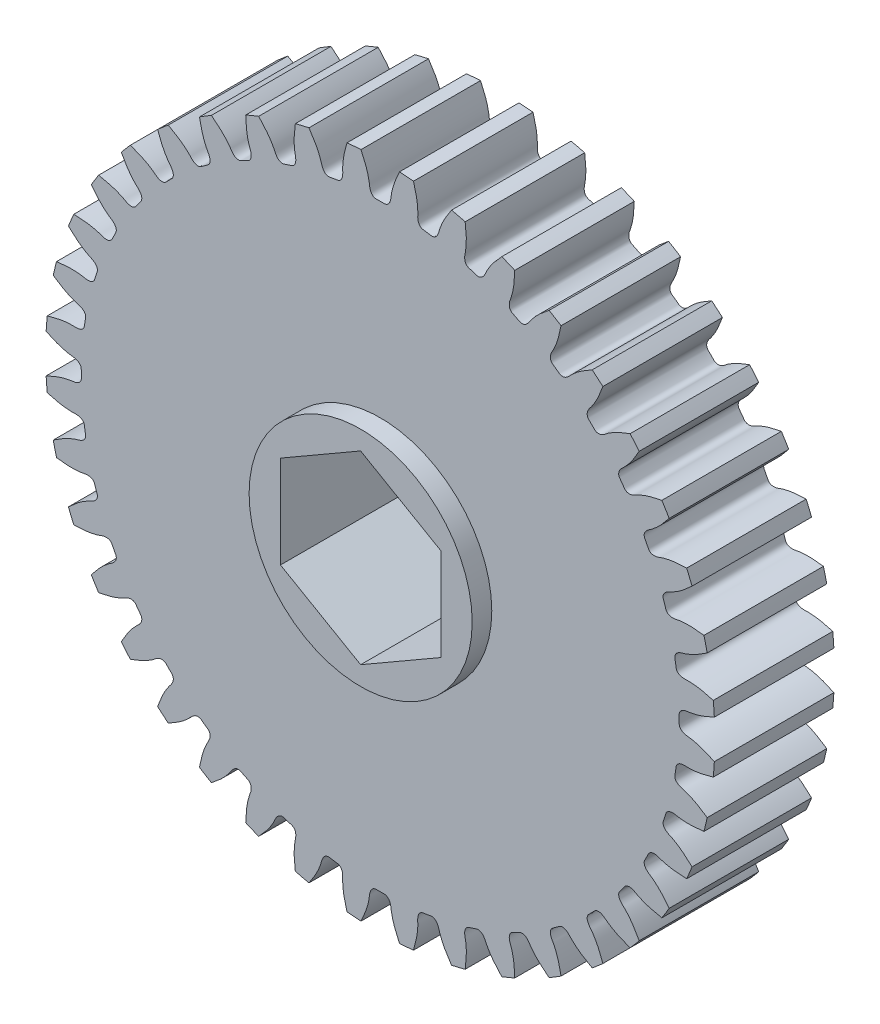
from build123d import *

# Parameters (mm, degrees)
BOSS_EXTRUDE1_DEPTH = 9.525
SKETCH2_R           = 8.89
BOSS_EXTRUDE2_DEPTH = 1.5621
BOSS_EXTRUDE3_START = 1.5621
SKETCH3_R           = 8.89
BOSS_EXTRUDE3_DEPTH = 1.5621
CUT_EXTRUDE1_DEPTH  = 40.722420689


with BuildPart() as part:
    # Sketch1 → Boss-Extrude1 (new body)
    with BuildSketch(Plane(origin=(0, 0, -4.7625), x_dir=(-1, 0, 0), z_dir=(0, 0, -1))):
        with BuildLine():
            ThreePointArc((-25.796844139, 6.768436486), (-25.933105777, 6.225987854), (-26.057962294, 5.680801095))
            add(Edge.make_bspline(
                [(-26.538058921, 2.649590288), (-26.346435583, 2.708405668), (-26.095635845, 2.777592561), (-25.787565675, 2.84804005), (-25.623095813, 2.882036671), (-25.468603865, 2.910607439), (-25.324240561, 2.934186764), (-25.190142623, 2.953213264), (-25.06643285, 2.968128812), (-24.953219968, 2.979378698), (-24.850598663, 2.987409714), (-24.758649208, 2.992674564), (-24.677438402, 2.995616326), (-24.607016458, 2.996714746), (-24.54742621, 2.996345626), (-24.481053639, 2.994767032), (-24.422080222, 2.990385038), (-24.36698261, 2.987604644), (-24.330087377, 2.986413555), (-24.294043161, 2.985903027), (-24.25881806, 2.986082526), (-24.22437529, 2.986955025), (-24.1906708, 2.988531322), (-24.157652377, 2.990828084), (-24.125258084, 2.993870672), (-24.093414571, 2.997695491), (-24.062035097, 3.002353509), (-24.031017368, 3.007914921), (-24.000241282, 3.014475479), (-23.969566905, 3.022165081), (-23.938833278, 3.031159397), (-23.90785924, 3.04169547), (-23.87644845, 3.054092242), (-23.844402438, 3.06877652), (-23.81154811, 3.08631336), (-23.77778938, 3.107435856), (-23.743196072, 3.133060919), (-23.708138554, 3.164262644), (-23.673470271, 3.202155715), (-23.640667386, 3.247631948), (-23.611960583, 3.30093819), (-23.590578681, 3.358597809), (-23.561503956, 3.501074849), (-23.536937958, 3.727884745), (-23.490213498, 3.951185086), (-23.473837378, 4.095673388), (-23.476354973, 4.157118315), (-23.48718423, 4.216686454), (-23.504328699, 4.27007357), (-23.525590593, 4.316825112), (-23.549290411, 4.357333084), (-23.574272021, 4.392393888), (-23.599851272, 4.422914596), (-23.625678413, 4.449745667), (-23.65161829, 4.473614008), (-23.677660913, 4.495110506), (-23.703863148, 4.514702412), (-23.730313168, 4.532753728), (-23.757110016, 4.549545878), (-23.784352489, 4.565295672), (-23.812133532, 4.580169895), (-23.840537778, 4.594296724), (-23.869640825, 4.60777453), (-23.899509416, 4.62067859), (-23.930202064, 4.633066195), (-23.961769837, 4.644980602), (-23.994257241, 4.656453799), (-24.027702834, 4.667509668), (-24.062140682, 4.678162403), (-24.097598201, 4.688430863), (-24.150858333, 4.70281265), (-24.208299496, 4.716868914), (-24.271911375, 4.735877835), (-24.328699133, 4.75394118), (-24.39533495, 4.776747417), (-24.471661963, 4.804640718), (-24.557484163, 4.838061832), (-24.652601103, 4.877411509), (-24.756796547, 4.923095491), (-24.869842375, 4.975509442), (-24.991497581, 5.035043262), (-25.121508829, 5.102079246), (-25.25961055, 5.176992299), (-25.405525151, 5.260148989), (-25.676747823, 5.42234745), (-25.893892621, 5.565649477), (-26.057962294, 5.680801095)],
                knots=[0, 0, 0, 0, 0.085621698, 0.111077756, 0.134991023, 0.157361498, 0.178189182, 0.197474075, 0.215216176, 0.231415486, 0.246072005, 0.259185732, 0.270756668, 0.280784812, 0.289270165, 0.296212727, 0.309141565, 0.314524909, 0.319779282, 0.324910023, 0.3299233, 0.334826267, 0.339627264, 0.344336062, 0.34896417, 0.353525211, 0.358035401, 0.362514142, 0.366984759, 0.37147542, 0.376020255, 0.380660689, 0.38544696, 0.390439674, 0.395711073, 0.401345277, 0.407436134, 0.414080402, 0.421363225, 0.429333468, 0.437970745, 0.447155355, 0.455484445, 0.5, 0.544515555, 0.552844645, 0.562029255, 0.570666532, 0.578636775, 0.585919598, 0.592563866, 0.598654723, 0.604288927, 0.609560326, 0.61455304, 0.619339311, 0.623979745, 0.62852458, 0.633015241, 0.637485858, 0.641964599, 0.646474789, 0.65103583, 0.655663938, 0.660372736, 0.665173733, 0.6700767, 0.675089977, 0.680220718, 0.685475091, 0.690858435, 0.703787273, 0.710729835, 0.719215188, 0.729243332, 0.740814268, 0.753927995, 0.768584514, 0.784783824, 0.802525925, 0.821810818, 0.842638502, 0.865008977, 0.888922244, 0.914378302, 1, 1, 1, 1], degree=3))
            ThreePointArc((-26.538058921, 2.649590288), (-26.587785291, 2.092504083), (-26.625818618, 1.534497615))
            add(Edge.make_bspline(
                [(-26.625818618, -1.534497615), (-26.445755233, -1.446429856), (-26.208866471, -1.338861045), (-25.915609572, -1.22108809), (-25.758482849, -1.161781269), (-25.610362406, -1.109394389), (-25.471465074, -1.063521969), (-25.341994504, -1.023752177), (-25.222141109, -0.989667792), (-25.112081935, -0.960846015), (-25.011980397, -0.936860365), (-24.921986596, -0.91727627), (-24.842235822, -0.901666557), (-24.772852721, -0.889565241), (-24.713938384, -0.880607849), (-24.648136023, -0.871784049), (-24.589203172, -0.866886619), (-24.534348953, -0.861013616), (-24.497721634, -0.856418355), (-24.462041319, -0.85128404), (-24.427277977, -0.84559633), (-24.393395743, -0.839346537), (-24.360352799, -0.832517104), (-24.32810018, -0.825083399), (-24.296580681, -0.817010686), (-24.265727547, -0.808251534), (-24.235463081, -0.798742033), (-24.205697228, -0.788396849), (-24.176326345, -0.777102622), (-24.147232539, -0.764709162), (-24.118284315, -0.751017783), (-24.089339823, -0.735766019), (-24.060255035, -0.718608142), (-24.03090069, -0.69909155), (-24.00119422, -0.676631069), (-23.971155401, -0.650487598), (-23.940996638, -0.619766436), (-23.911251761, -0.583464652), (-23.882938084, -0.540614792), (-23.857653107, -0.490566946), (-23.837638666, -0.433426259), (-23.825539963, -0.373131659), (-23.819111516, -0.227860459), (-23.83032885, 0), (-23.819111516, 0.227860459), (-23.825539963, 0.373131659), (-23.837638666, 0.433426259), (-23.857653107, 0.490566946), (-23.882938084, 0.540614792), (-23.911251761, 0.583464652), (-23.940996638, 0.619766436), (-23.971155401, 0.650487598), (-24.00119422, 0.676631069), (-24.03090069, 0.69909155), (-24.060255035, 0.718608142), (-24.089339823, 0.735766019), (-24.118284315, 0.751017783), (-24.147232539, 0.764709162), (-24.176326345, 0.777102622), (-24.205697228, 0.788396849), (-24.235463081, 0.798742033), (-24.265727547, 0.808251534), (-24.296580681, 0.817010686), (-24.32810018, 0.825083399), (-24.360352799, 0.832517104), (-24.393395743, 0.839346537), (-24.427277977, 0.84559633), (-24.462041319, 0.85128404), (-24.497721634, 0.856418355), (-24.534348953, 0.861013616), (-24.589203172, 0.866886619), (-24.648136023, 0.871784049), (-24.713938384, 0.880607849), (-24.772852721, 0.889565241), (-24.842235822, 0.901666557), (-24.921986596, 0.91727627), (-25.011980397, 0.936860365), (-25.112081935, 0.960846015), (-25.222141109, 0.989667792), (-25.341994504, 1.023752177), (-25.471465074, 1.063521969), (-25.610362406, 1.109394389), (-25.758482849, 1.161781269), (-25.915609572, 1.22108809), (-26.208866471, 1.338861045), (-26.445755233, 1.446429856), (-26.625818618, 1.534497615)],
                knots=[0, 0, 0, 0, 0.085621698, 0.111077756, 0.134991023, 0.157361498, 0.178189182, 0.197474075, 0.215216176, 0.231415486, 0.246072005, 0.259185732, 0.270756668, 0.280784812, 0.289270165, 0.296212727, 0.309141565, 0.314524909, 0.319779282, 0.324910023, 0.3299233, 0.334826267, 0.339627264, 0.344336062, 0.34896417, 0.353525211, 0.358035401, 0.362514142, 0.366984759, 0.37147542, 0.376020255, 0.380660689, 0.38544696, 0.390439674, 0.395711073, 0.401345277, 0.407436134, 0.414080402, 0.421363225, 0.429333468, 0.437970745, 0.447155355, 0.455484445, 0.5, 0.544515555, 0.552844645, 0.562029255, 0.570666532, 0.578636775, 0.585919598, 0.592563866, 0.598654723, 0.604288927, 0.609560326, 0.61455304, 0.619339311, 0.623979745, 0.62852458, 0.633015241, 0.637485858, 0.641964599, 0.646474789, 0.65103583, 0.655663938, 0.660372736, 0.665173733, 0.6700767, 0.675089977, 0.680220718, 0.685475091, 0.690858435, 0.703787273, 0.710729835, 0.719215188, 0.729243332, 0.740814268, 0.753927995, 0.768584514, 0.784783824, 0.802525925, 0.821810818, 0.842638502, 0.865008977, 0.888922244, 0.914378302, 1, 1, 1, 1], degree=3))
            ThreePointArc((-26.625818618, -1.534497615), (-26.587785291, -2.092504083), (-26.538058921, -2.649590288))
            add(Edge.make_bspline(
                [(-26.057962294, -5.680801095), (-25.893892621, -5.565649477), (-25.676747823, -5.42234745), (-25.405525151, -5.260148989), (-25.25961055, -5.176992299), (-25.121508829, -5.102079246), (-24.991497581, -5.035043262), (-24.869842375, -4.975509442), (-24.756796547, -4.923095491), (-24.652601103, -4.877411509), (-24.557484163, -4.838061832), (-24.471661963, -4.804640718), (-24.39533495, -4.776747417), (-24.328699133, -4.75394118), (-24.271911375, -4.735877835), (-24.208299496, -4.716868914), (-24.150858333, -4.70281265), (-24.097598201, -4.688430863), (-24.062140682, -4.678162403), (-24.027702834, -4.667509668), (-23.994257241, -4.656453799), (-23.961769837, -4.644980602), (-23.930202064, -4.633066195), (-23.899509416, -4.62067859), (-23.869640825, -4.60777453), (-23.840537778, -4.594296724), (-23.812133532, -4.580169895), (-23.784352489, -4.565295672), (-23.757110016, -4.549545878), (-23.730313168, -4.532753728), (-23.703863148, -4.514702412), (-23.677660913, -4.495110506), (-23.65161829, -4.473614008), (-23.625678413, -4.449745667), (-23.599851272, -4.422914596), (-23.574272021, -4.392393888), (-23.549290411, -4.357333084), (-23.525590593, -4.316825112), (-23.504328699, -4.27007357), (-23.48718423, -4.216686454), (-23.476354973, -4.157118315), (-23.473837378, -4.095673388), (-23.490213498, -3.951185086), (-23.536937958, -3.727884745), (-23.561503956, -3.501074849), (-23.590578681, -3.358597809), (-23.611960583, -3.30093819), (-23.640667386, -3.247631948), (-23.673470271, -3.202155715), (-23.708138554, -3.164262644), (-23.743196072, -3.133060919), (-23.77778938, -3.107435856), (-23.81154811, -3.08631336), (-23.844402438, -3.06877652), (-23.87644845, -3.054092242), (-23.90785924, -3.04169547), (-23.938833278, -3.031159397), (-23.969566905, -3.022165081), (-24.000241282, -3.014475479), (-24.031017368, -3.007914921), (-24.062035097, -3.002353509), (-24.093414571, -2.997695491), (-24.125258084, -2.993870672), (-24.157652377, -2.990828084), (-24.1906708, -2.988531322), (-24.22437529, -2.986955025), (-24.25881806, -2.986082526), (-24.294043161, -2.985903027), (-24.330087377, -2.986413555), (-24.36698261, -2.987604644), (-24.422080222, -2.990385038), (-24.481053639, -2.994767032), (-24.54742621, -2.996345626), (-24.607016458, -2.996714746), (-24.677438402, -2.995616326), (-24.758649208, -2.992674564), (-24.850598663, -2.987409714), (-24.953219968, -2.979378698), (-25.06643285, -2.968128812), (-25.190142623, -2.953213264), (-25.324240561, -2.934186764), (-25.468603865, -2.910607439), (-25.623095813, -2.882036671), (-25.787565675, -2.84804005), (-26.095635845, -2.777592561), (-26.346435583, -2.708405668), (-26.538058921, -2.649590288)],
                knots=[0, 0, 0, 0, 0.085621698, 0.111077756, 0.134991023, 0.157361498, 0.178189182, 0.197474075, 0.215216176, 0.231415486, 0.246072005, 0.259185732, 0.270756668, 0.280784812, 0.289270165, 0.296212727, 0.309141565, 0.314524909, 0.319779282, 0.324910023, 0.3299233, 0.334826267, 0.339627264, 0.344336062, 0.34896417, 0.353525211, 0.358035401, 0.362514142, 0.366984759, 0.37147542, 0.376020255, 0.380660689, 0.38544696, 0.390439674, 0.395711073, 0.401345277, 0.407436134, 0.414080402, 0.421363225, 0.429333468, 0.437970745, 0.447155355, 0.455484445, 0.5, 0.544515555, 0.552844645, 0.562029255, 0.570666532, 0.578636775, 0.585919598, 0.592563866, 0.598654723, 0.604288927, 0.609560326, 0.61455304, 0.619339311, 0.623979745, 0.62852458, 0.633015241, 0.637485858, 0.641964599, 0.646474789, 0.65103583, 0.655663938, 0.660372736, 0.665173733, 0.6700767, 0.675089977, 0.680220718, 0.685475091, 0.690858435, 0.703787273, 0.710729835, 0.719215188, 0.729243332, 0.740814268, 0.753927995, 0.768584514, 0.784783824, 0.802525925, 0.821810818, 0.842638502, 0.865008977, 0.888922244, 0.914378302, 1, 1, 1, 1], degree=3))
            ThreePointArc((-26.057962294, -5.680801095), (-25.933105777, -6.225987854), (-25.796844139, -6.768436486))
            add(Edge.make_bspline(
                [(-24.848472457, -9.687224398), (-24.704436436, -9.547824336), (-24.512382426, -9.372317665), (-24.269872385, -9.169687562), (-24.138762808, -9.064728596), (-24.014080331, -8.969133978), (-23.896156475, -8.882585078), (-23.785312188, -8.804753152), (-23.681857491, -8.73530024), (-23.586091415, -8.673878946), (-23.498301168, -8.620134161), (-23.418763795, -8.573698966), (-23.347739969, -8.534208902), (-23.28549223, -8.501259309), (-23.232229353, -8.474534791), (-23.172374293, -8.445808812), (-23.117839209, -8.422939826), (-23.067484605, -8.400403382), (-23.034069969, -8.384714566), (-23.001722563, -8.368805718), (-22.970418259, -8.352653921), (-22.940125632, -8.336239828), (-22.910810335, -8.31953382), (-22.882433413, -8.30249734), (-22.854951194, -8.285079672), (-22.828314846, -8.267215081), (-22.802470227, -8.248818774), (-22.777358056, -8.229781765), (-22.752914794, -8.209964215), (-22.72907473, -8.189186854), (-22.705774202, -8.167220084), (-22.682959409, -8.143770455), (-22.660600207, -8.118464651), (-22.638713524, -8.090832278), (-22.617401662, -8.060291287), (-22.596911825, -8.026144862), (-22.577722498, -7.987607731), (-22.560651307, -7.94389101), (-22.546964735, -7.894388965), (-22.538382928, -7.838977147), (-22.537005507, -7.778448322), (-22.544131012, -7.717366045), (-22.582908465, -7.577218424), (-22.663989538, -7.363976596), (-22.723733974, -7.143802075), (-22.77473906, -7.007627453), (-22.804877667, -6.954022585), (-22.841569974, -6.905863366), (-22.881083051, -6.866078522), (-22.921252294, -6.834075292), (-22.96075922, -6.808741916), (-22.99893527, -6.788843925), (-23.035582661, -6.773262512), (-23.070775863, -6.761081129), (-23.104724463, -6.751590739), (-23.137687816, -6.744260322), (-23.169928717, -6.738699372), (-23.201690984, -6.73462359), (-23.233190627, -6.73182719), (-23.264614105, -6.730161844), (-23.296119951, -6.729521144), (-23.327841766, -6.729829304), (-23.359891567, -6.731032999), (-23.392362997, -6.733095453), (-23.425334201, -6.735992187), (-23.45887032, -6.739707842), (-23.493025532, -6.744234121), (-23.527845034, -6.749567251), (-23.563365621, -6.755710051), (-23.599620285, -6.762658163), (-23.653604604, -6.77402349), (-23.711166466, -6.78757701), (-23.776474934, -6.799519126), (-23.835273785, -6.80920567), (-23.905000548, -6.819137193), (-23.985671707, -6.828935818), (-24.077312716, -6.838119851), (-24.17992691, -6.846241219), (-24.293505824, -6.852840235), (-24.41802583, -6.857460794), (-24.5534492, -6.85964608), (-24.699723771, -6.858940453), (-24.85678312, -6.854889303), (-25.024546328, -6.847039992), (-25.339844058, -6.825652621), (-25.59837925, -6.796551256), (-25.796844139, -6.768436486)],
                knots=[0, 0, 0, 0, 0.085621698, 0.111077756, 0.134991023, 0.157361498, 0.178189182, 0.197474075, 0.215216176, 0.231415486, 0.246072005, 0.259185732, 0.270756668, 0.280784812, 0.289270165, 0.296212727, 0.309141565, 0.314524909, 0.319779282, 0.324910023, 0.3299233, 0.334826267, 0.339627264, 0.344336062, 0.34896417, 0.353525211, 0.358035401, 0.362514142, 0.366984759, 0.37147542, 0.376020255, 0.380660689, 0.38544696, 0.390439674, 0.395711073, 0.401345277, 0.407436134, 0.414080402, 0.421363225, 0.429333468, 0.437970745, 0.447155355, 0.455484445, 0.5, 0.544515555, 0.552844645, 0.562029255, 0.570666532, 0.578636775, 0.585919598, 0.592563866, 0.598654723, 0.604288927, 0.609560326, 0.61455304, 0.619339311, 0.623979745, 0.62852458, 0.633015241, 0.637485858, 0.641964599, 0.646474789, 0.65103583, 0.655663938, 0.660372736, 0.665173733, 0.6700767, 0.675089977, 0.680220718, 0.685475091, 0.690858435, 0.703787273, 0.710729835, 0.719215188, 0.729243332, 0.740814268, 0.753927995, 0.768584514, 0.784783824, 0.802525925, 0.821810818, 0.842638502, 0.865008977, 0.888922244, 0.914378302, 1, 1, 1, 1], degree=3))
            ThreePointArc((-24.848472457, -9.687224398), (-24.639867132, -10.206167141), (-24.42042544, -10.720621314))
            add(Edge.make_bspline(
                [(-23.027130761, -13.455116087), (-22.906675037, -13.294900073), (-22.744440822, -13.091510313), (-22.536614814, -12.853437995), (-22.423538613, -12.729261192), (-22.315345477, -12.615338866), (-22.212412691, -12.511408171), (-22.115108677, -12.417194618), (-22.023792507, -12.332412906), (-21.938813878, -12.256766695), (-21.860512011, -12.189950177), (-21.789217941, -12.13164429), (-21.725246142, -12.081529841), (-21.668919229, -12.039248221), (-21.620492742, -12.004520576), (-21.565868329, -11.966784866), (-21.515582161, -11.935666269), (-21.469372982, -11.905530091), (-21.438824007, -11.884807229), (-21.409363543, -11.864033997), (-21.380971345, -11.843183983), (-21.353619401, -11.822233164), (-21.327278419, -11.801146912), (-21.301915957, -11.77988105), (-21.277496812, -11.758378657), (-21.253983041, -11.736567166), (-21.231334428, -11.714354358), (-21.209509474, -11.691623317), (-21.188467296, -11.668225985), (-21.168171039, -11.643975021), (-21.148593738, -11.618633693), (-21.129728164, -11.591903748), (-21.111602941, -11.56341175), (-21.094308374, -11.532695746), (-21.078036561, -11.499196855), (-21.063140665, -11.462265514), (-21.050216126, -11.421200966), (-21.040193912, -11.375351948), (-21.03441967, -11.324318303), (-21.034611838, -11.268246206), (-21.042720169, -11.208247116), (-21.059313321, -11.149031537), (-21.119537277, -11.016675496), (-21.232978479, -10.818742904), (-21.326430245, -10.610625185), (-21.398109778, -10.484106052), (-21.436262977, -10.435875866), (-21.480037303, -10.394049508), (-21.525287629, -10.360935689), (-21.56996873, -10.335610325), (-21.612952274, -10.31676909), (-21.653771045, -10.303088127), (-21.692404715, -10.293431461), (-21.729070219, -10.286905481), (-21.764085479, -10.282842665), (-21.797789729, -10.280759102), (-21.830503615, -10.280310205), (-21.862512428, -10.281253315), (-21.894061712, -10.283418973), (-21.925358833, -10.286689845), (-21.956577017, -10.290985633), (-21.987860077, -10.296252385), (-22.019326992, -10.302454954), (-22.051076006, -10.309571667), (-22.083188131, -10.31759057), (-22.115730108, -10.326506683), (-22.148756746, -10.336320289), (-22.182313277, -10.347034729), (-22.216435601, -10.358658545), (-22.251156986, -10.371192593), (-22.30269874, -10.390863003), (-22.357431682, -10.413254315), (-22.420067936, -10.435265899), (-22.476627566, -10.454031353), (-22.543942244, -10.474748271), (-22.622087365, -10.497046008), (-22.711163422, -10.520452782), (-22.811243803, -10.544526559), (-22.922392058, -10.568811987), (-23.044656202, -10.59285488), (-23.178070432, -10.616198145), (-23.322654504, -10.638383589), (-23.478413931, -10.658951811), (-23.645339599, -10.677443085), (-23.960101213, -10.70564246), (-24.220005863, -10.717343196), (-24.42042544, -10.720621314)],
                knots=[0, 0, 0, 0, 0.085621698, 0.111077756, 0.134991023, 0.157361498, 0.178189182, 0.197474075, 0.215216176, 0.231415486, 0.246072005, 0.259185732, 0.270756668, 0.280784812, 0.289270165, 0.296212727, 0.309141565, 0.314524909, 0.319779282, 0.324910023, 0.3299233, 0.334826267, 0.339627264, 0.344336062, 0.34896417, 0.353525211, 0.358035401, 0.362514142, 0.366984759, 0.37147542, 0.376020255, 0.380660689, 0.38544696, 0.390439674, 0.395711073, 0.401345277, 0.407436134, 0.414080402, 0.421363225, 0.429333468, 0.437970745, 0.447155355, 0.455484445, 0.5, 0.544515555, 0.552844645, 0.562029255, 0.570666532, 0.578636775, 0.585919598, 0.592563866, 0.598654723, 0.604288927, 0.609560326, 0.61455304, 0.619339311, 0.623979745, 0.62852458, 0.633015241, 0.637485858, 0.641964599, 0.646474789, 0.65103583, 0.655663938, 0.660372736, 0.665173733, 0.6700767, 0.675089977, 0.680220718, 0.685475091, 0.690858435, 0.703787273, 0.710729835, 0.719215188, 0.729243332, 0.740814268, 0.753927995, 0.768584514, 0.784783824, 0.802525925, 0.821810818, 0.842638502, 0.865008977, 0.888922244, 0.914378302, 1, 1, 1, 1], degree=3))
            ThreePointArc((-23.027130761, -13.455116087), (-22.739913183, -13.935036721), (-22.442694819, -14.408828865))
            add(Edge.make_bspline(
                [(-20.638784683, -16.891698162), (-20.544875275, -16.714611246), (-20.416455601, -16.48834653), (-20.248430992, -16.220694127), (-20.156172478, -16.080357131), (-20.067132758, -15.950912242), (-19.981725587, -15.832158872), (-19.900357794, -15.723883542), (-19.823428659, -15.625860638), (-19.751329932, -15.537852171), (-19.684444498, -15.459609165), (-19.623149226, -15.39086827), (-19.567804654, -15.331363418), (-19.518785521, -15.280790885), (-19.476387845, -15.238915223), (-19.428339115, -15.193098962), (-19.383540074, -15.154496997), (-19.342614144, -15.117503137), (-19.315683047, -15.092256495), (-19.28983494, -15.067130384), (-19.265053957, -15.04209555), (-19.241316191, -15.017123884), (-19.218598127, -14.992176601), (-19.196874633, -14.967204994), (-19.176119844, -14.942147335), (-19.156307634, -14.916926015), (-19.137412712, -14.89144366), (-19.119412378, -14.865578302), (-19.102289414, -14.839177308), (-19.086036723, -14.812049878), (-19.070664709, -14.78395798), (-19.056212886, -14.754605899), (-19.042767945, -14.723629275), (-19.030491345, -14.69058597), (-19.019660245, -14.654954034), (-19.010725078, -14.616147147), (-19.004383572, -14.573566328), (-19.001657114, -14.526713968), (-19.003937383, -14.475405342), (-19.012898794, -14.420053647), (-19.030293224, -14.362061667), (-19.055945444, -14.306170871), (-19.13613299, -14.184865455), (-19.279141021, -14.007115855), (-19.403999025, -13.816179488), (-19.494588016, -13.702431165), (-19.53981635, -13.660763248), (-19.589594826, -13.626299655), (-19.639468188, -13.600672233), (-19.687560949, -13.58264833), (-19.732962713, -13.57076317), (-19.775419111, -13.563636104), (-19.815087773, -13.560141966), (-19.852322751, -13.55943208), (-19.88754248, -13.560896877), (-19.921157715, -13.564111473), (-19.953539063, -13.568785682), (-19.985006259, -13.574724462), (-20.015828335, -13.581798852), (-20.046228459, -13.589925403), (-20.076390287, -13.599051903), (-20.106464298, -13.609147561), (-20.136573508, -13.620196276), (-20.16681834, -13.63219201), (-20.197280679, -13.645135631), (-20.228027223, -13.659032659), (-20.259112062, -13.673891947), (-20.290579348, -13.689723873), (-20.322463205, -13.706542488), (-20.354796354, -13.724353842), (-20.402626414, -13.751844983), (-20.45318273, -13.782522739), (-20.511604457, -13.814061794), (-20.56453218, -13.841444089), (-20.627777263, -13.872436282), (-20.701472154, -13.906684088), (-20.78578991, -13.943737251), (-20.880872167, -13.983170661), (-20.986852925, -14.024544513), (-21.103850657, -14.067417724), (-21.231970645, -14.111344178), (-21.371304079, -14.155874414), (-21.521928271, -14.20055555), (-21.683906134, -14.244932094), (-21.990381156, -14.322023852), (-22.245255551, -14.374238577), (-22.442694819, -14.408828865)],
                knots=[0, 0, 0, 0, 0.085621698, 0.111077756, 0.134991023, 0.157361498, 0.178189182, 0.197474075, 0.215216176, 0.231415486, 0.246072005, 0.259185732, 0.270756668, 0.280784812, 0.289270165, 0.296212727, 0.309141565, 0.314524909, 0.319779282, 0.324910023, 0.3299233, 0.334826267, 0.339627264, 0.344336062, 0.34896417, 0.353525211, 0.358035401, 0.362514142, 0.366984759, 0.37147542, 0.376020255, 0.380660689, 0.38544696, 0.390439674, 0.395711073, 0.401345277, 0.407436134, 0.414080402, 0.421363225, 0.429333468, 0.437970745, 0.447155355, 0.455484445, 0.5, 0.544515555, 0.552844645, 0.562029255, 0.570666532, 0.578636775, 0.585919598, 0.592563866, 0.598654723, 0.604288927, 0.609560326, 0.61455304, 0.619339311, 0.623979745, 0.62852458, 0.633015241, 0.637485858, 0.641964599, 0.646474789, 0.65103583, 0.655663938, 0.660372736, 0.665173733, 0.6700767, 0.675089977, 0.680220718, 0.685475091, 0.690858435, 0.703787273, 0.710729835, 0.719215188, 0.729243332, 0.740814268, 0.753927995, 0.768584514, 0.784783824, 0.802525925, 0.821810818, 0.842638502, 0.865008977, 0.888922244, 0.914378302, 1, 1, 1, 1], degree=3))
            ThreePointArc((-20.638784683, -16.891698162), (-20.280027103, -17.320779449), (-19.912350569, -17.74224323))
            add(Edge.make_bspline(
                [(-17.74224323, -19.912350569), (-17.677192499, -19.722753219), (-17.585749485, -19.479184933), (-17.461663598, -19.188542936), (-17.392494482, -19.03550131), (-17.32480063, -18.893721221), (-17.259022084, -18.763069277), (-17.195594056, -18.643398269), (-17.134946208, -18.534547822), (-17.077502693, -18.436344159), (-17.023680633, -18.348601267), (-16.973893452, -18.271117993), (-16.928538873, -18.203687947), (-16.888034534, -18.146069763), (-16.85270964, -18.098077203), (-16.812419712, -18.045308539), (-16.7742109, -18.000173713), (-16.73957595, -17.957233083), (-16.716925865, -17.928084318), (-16.695326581, -17.899224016), (-16.674767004, -17.870620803), (-16.655227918, -17.842243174), (-16.636692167, -17.814049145), (-16.619142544, -17.785986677), (-16.602563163, -17.757990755), (-16.586940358, -17.72998064), (-16.572264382, -17.701856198), (-16.558531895, -17.673493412), (-16.545749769, -17.644738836), (-16.533940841, -17.61540291), (-16.523152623, -17.585252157), (-16.513470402, -17.554000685), (-16.505036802, -17.521302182), (-16.49808046, -17.486745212), (-16.492956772, -17.449857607), (-16.490202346, -17.410130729), (-16.490600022, -17.367082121), (-16.495236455, -17.320380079), (-16.505515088, -17.27005986), (-16.523025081, -17.216791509), (-16.549277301, -17.162234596), (-16.583356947, -17.1110448), (-16.681533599, -17.00377695), (-16.850587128, -16.850587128), (-17.00377695, -16.681533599), (-17.1110448, -16.583356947), (-17.162234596, -16.549277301), (-17.216791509, -16.523025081), (-17.27005986, -16.505515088), (-17.320380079, -16.495236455), (-17.367082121, -16.490600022), (-17.410130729, -16.490202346), (-17.449857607, -16.492956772), (-17.486745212, -16.49808046), (-17.521302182, -16.505036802), (-17.554000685, -16.513470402), (-17.585252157, -16.523152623), (-17.61540291, -16.533940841), (-17.644738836, -16.545749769), (-17.673493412, -16.558531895), (-17.701856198, -16.572264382), (-17.72998064, -16.586940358), (-17.757990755, -16.602563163), (-17.785986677, -16.619142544), (-17.814049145, -16.636692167), (-17.842243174, -16.655227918), (-17.870620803, -16.674767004), (-17.899224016, -16.695326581), (-17.928084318, -16.716925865), (-17.957233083, -16.73957595), (-18.000173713, -16.7742109), (-18.045308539, -16.812419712), (-18.098077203, -16.85270964), (-18.146069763, -16.888034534), (-18.203687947, -16.928538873), (-18.271117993, -16.973893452), (-18.348601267, -17.023680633), (-18.436344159, -17.077502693), (-18.534547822, -17.134946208), (-18.643398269, -17.195594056), (-18.763069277, -17.259022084), (-18.893721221, -17.32480063), (-19.03550131, -17.392494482), (-19.188542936, -17.461663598), (-19.479184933, -17.585749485), (-19.722753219, -17.677192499), (-19.912350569, -17.74224323)],
                knots=[0, 0, 0, 0, 0.085621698, 0.111077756, 0.134991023, 0.157361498, 0.178189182, 0.197474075, 0.215216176, 0.231415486, 0.246072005, 0.259185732, 0.270756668, 0.280784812, 0.289270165, 0.296212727, 0.309141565, 0.314524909, 0.319779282, 0.324910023, 0.3299233, 0.334826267, 0.339627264, 0.344336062, 0.34896417, 0.353525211, 0.358035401, 0.362514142, 0.366984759, 0.37147542, 0.376020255, 0.380660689, 0.38544696, 0.390439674, 0.395711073, 0.401345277, 0.407436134, 0.414080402, 0.421363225, 0.429333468, 0.437970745, 0.447155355, 0.455484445, 0.5, 0.544515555, 0.552844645, 0.562029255, 0.570666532, 0.578636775, 0.585919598, 0.592563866, 0.598654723, 0.604288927, 0.609560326, 0.61455304, 0.619339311, 0.623979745, 0.62852458, 0.633015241, 0.637485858, 0.641964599, 0.646474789, 0.65103583, 0.655663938, 0.660372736, 0.665173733, 0.6700767, 0.675089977, 0.680220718, 0.685475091, 0.690858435, 0.703787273, 0.710729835, 0.719215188, 0.729243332, 0.740814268, 0.753927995, 0.768584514, 0.784783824, 0.802525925, 0.821810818, 0.842638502, 0.865008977, 0.888922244, 0.914378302, 1, 1, 1, 1], degree=3))
            ThreePointArc((-17.74224323, -19.912350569), (-17.320779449, -20.280027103), (-16.891698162, -20.638784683))
            add(Edge.make_bspline(
                [(-14.408828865, -22.442694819), (-14.374238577, -22.245255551), (-14.322023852, -21.990381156), (-14.244932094, -21.683906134), (-14.20055555, -21.521928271), (-14.155874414, -21.371304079), (-14.111344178, -21.231970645), (-14.067417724, -21.103850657), (-14.024544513, -20.986852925), (-13.983170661, -20.880872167), (-13.943737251, -20.78578991), (-13.906684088, -20.701472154), (-13.872436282, -20.627777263), (-13.841444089, -20.56453218), (-13.814061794, -20.511604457), (-13.782522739, -20.45318273), (-13.751844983, -20.402626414), (-13.724353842, -20.354796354), (-13.706542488, -20.322463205), (-13.689723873, -20.290579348), (-13.673891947, -20.259112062), (-13.659032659, -20.228027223), (-13.645135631, -20.197280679), (-13.63219201, -20.16681834), (-13.620196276, -20.136573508), (-13.609147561, -20.106464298), (-13.599051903, -20.076390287), (-13.589925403, -20.046228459), (-13.581798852, -20.015828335), (-13.574724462, -19.985006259), (-13.568785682, -19.953539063), (-13.564111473, -19.921157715), (-13.560896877, -19.88754248), (-13.55943208, -19.852322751), (-13.560141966, -19.815087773), (-13.563636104, -19.775419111), (-13.57076317, -19.732962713), (-13.58264833, -19.687560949), (-13.600672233, -19.639468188), (-13.626299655, -19.589594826), (-13.660763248, -19.53981635), (-13.702431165, -19.494588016), (-13.816179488, -19.403999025), (-14.007115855, -19.279141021), (-14.184865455, -19.13613299), (-14.306170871, -19.055945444), (-14.362061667, -19.030293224), (-14.420053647, -19.012898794), (-14.475405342, -19.003937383), (-14.526713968, -19.001657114), (-14.573566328, -19.004383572), (-14.616147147, -19.010725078), (-14.654954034, -19.019660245), (-14.69058597, -19.030491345), (-14.723629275, -19.042767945), (-14.754605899, -19.056212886), (-14.78395798, -19.070664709), (-14.812049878, -19.086036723), (-14.839177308, -19.102289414), (-14.865578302, -19.119412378), (-14.89144366, -19.137412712), (-14.916926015, -19.156307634), (-14.942147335, -19.176119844), (-14.967204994, -19.196874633), (-14.992176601, -19.218598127), (-15.017123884, -19.241316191), (-15.04209555, -19.265053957), (-15.067130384, -19.28983494), (-15.092256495, -19.315683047), (-15.117503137, -19.342614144), (-15.154496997, -19.383540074), (-15.193098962, -19.428339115), (-15.238915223, -19.476387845), (-15.280790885, -19.518785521), (-15.331363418, -19.567804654), (-15.39086827, -19.623149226), (-15.459609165, -19.684444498), (-15.537852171, -19.751329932), (-15.625860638, -19.823428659), (-15.723883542, -19.900357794), (-15.832158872, -19.981725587), (-15.950912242, -20.067132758), (-16.080357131, -20.156172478), (-16.220694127, -20.248430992), (-16.48834653, -20.416455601), (-16.714611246, -20.544875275), (-16.891698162, -20.638784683)],
                knots=[0, 0, 0, 0, 0.085621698, 0.111077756, 0.134991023, 0.157361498, 0.178189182, 0.197474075, 0.215216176, 0.231415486, 0.246072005, 0.259185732, 0.270756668, 0.280784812, 0.289270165, 0.296212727, 0.309141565, 0.314524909, 0.319779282, 0.324910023, 0.3299233, 0.334826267, 0.339627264, 0.344336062, 0.34896417, 0.353525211, 0.358035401, 0.362514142, 0.366984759, 0.37147542, 0.376020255, 0.380660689, 0.38544696, 0.390439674, 0.395711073, 0.401345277, 0.407436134, 0.414080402, 0.421363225, 0.429333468, 0.437970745, 0.447155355, 0.455484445, 0.5, 0.544515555, 0.552844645, 0.562029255, 0.570666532, 0.578636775, 0.585919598, 0.592563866, 0.598654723, 0.604288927, 0.609560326, 0.61455304, 0.619339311, 0.623979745, 0.62852458, 0.633015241, 0.637485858, 0.641964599, 0.646474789, 0.65103583, 0.655663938, 0.660372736, 0.665173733, 0.6700767, 0.675089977, 0.680220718, 0.685475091, 0.690858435, 0.703787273, 0.710729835, 0.719215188, 0.729243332, 0.740814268, 0.753927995, 0.768584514, 0.784783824, 0.802525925, 0.821810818, 0.842638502, 0.865008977, 0.888922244, 0.914378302, 1, 1, 1, 1], degree=3))
            ThreePointArc((-14.408828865, -22.442694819), (-13.935036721, -22.739913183), (-13.455116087, -23.027130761))
            add(Edge.make_bspline(
                [(-10.720621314, -24.42042544), (-10.717343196, -24.220005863), (-10.70564246, -23.960101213), (-10.677443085, -23.645339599), (-10.658951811, -23.478413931), (-10.638383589, -23.322654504), (-10.616198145, -23.178070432), (-10.59285488, -23.044656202), (-10.568811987, -22.922392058), (-10.544526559, -22.811243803), (-10.520452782, -22.711163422), (-10.497046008, -22.622087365), (-10.474748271, -22.543942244), (-10.454031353, -22.476627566), (-10.435265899, -22.420067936), (-10.413254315, -22.357431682), (-10.390863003, -22.30269874), (-10.371192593, -22.251156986), (-10.358658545, -22.216435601), (-10.347034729, -22.182313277), (-10.336320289, -22.148756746), (-10.326506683, -22.115730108), (-10.31759057, -22.083188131), (-10.309571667, -22.051076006), (-10.302454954, -22.019326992), (-10.296252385, -21.987860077), (-10.290985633, -21.956577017), (-10.286689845, -21.925358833), (-10.283418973, -21.894061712), (-10.281253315, -21.862512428), (-10.280310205, -21.830503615), (-10.280759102, -21.797789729), (-10.282842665, -21.764085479), (-10.286905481, -21.729070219), (-10.293431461, -21.692404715), (-10.303088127, -21.653771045), (-10.31676909, -21.612952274), (-10.335610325, -21.56996873), (-10.360935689, -21.525287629), (-10.394049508, -21.480037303), (-10.435875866, -21.436262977), (-10.484106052, -21.398109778), (-10.610625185, -21.326430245), (-10.818742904, -21.232978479), (-11.016675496, -21.119537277), (-11.149031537, -21.059313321), (-11.208247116, -21.042720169), (-11.268246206, -21.034611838), (-11.324318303, -21.03441967), (-11.375351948, -21.040193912), (-11.421200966, -21.050216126), (-11.462265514, -21.063140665), (-11.499196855, -21.078036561), (-11.532695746, -21.094308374), (-11.56341175, -21.111602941), (-11.591903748, -21.129728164), (-11.618633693, -21.148593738), (-11.643975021, -21.168171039), (-11.668225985, -21.188467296), (-11.691623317, -21.209509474), (-11.714354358, -21.231334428), (-11.736567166, -21.253983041), (-11.758378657, -21.277496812), (-11.77988105, -21.301915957), (-11.801146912, -21.327278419), (-11.822233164, -21.353619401), (-11.843183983, -21.380971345), (-11.864033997, -21.409363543), (-11.884807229, -21.438824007), (-11.905530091, -21.469372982), (-11.935666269, -21.515582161), (-11.966784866, -21.565868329), (-12.004520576, -21.620492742), (-12.039248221, -21.668919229), (-12.081529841, -21.725246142), (-12.13164429, -21.789217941), (-12.189950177, -21.860512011), (-12.256766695, -21.938813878), (-12.332412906, -22.023792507), (-12.417194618, -22.115108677), (-12.511408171, -22.212412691), (-12.615338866, -22.315345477), (-12.729261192, -22.423538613), (-12.853437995, -22.536614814), (-13.091510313, -22.744440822), (-13.294900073, -22.906675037), (-13.455116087, -23.027130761)],
                knots=[0, 0, 0, 0, 0.085621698, 0.111077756, 0.134991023, 0.157361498, 0.178189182, 0.197474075, 0.215216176, 0.231415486, 0.246072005, 0.259185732, 0.270756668, 0.280784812, 0.289270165, 0.296212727, 0.309141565, 0.314524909, 0.319779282, 0.324910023, 0.3299233, 0.334826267, 0.339627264, 0.344336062, 0.34896417, 0.353525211, 0.358035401, 0.362514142, 0.366984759, 0.37147542, 0.376020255, 0.380660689, 0.38544696, 0.390439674, 0.395711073, 0.401345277, 0.407436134, 0.414080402, 0.421363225, 0.429333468, 0.437970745, 0.447155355, 0.455484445, 0.5, 0.544515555, 0.552844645, 0.562029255, 0.570666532, 0.578636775, 0.585919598, 0.592563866, 0.598654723, 0.604288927, 0.609560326, 0.61455304, 0.619339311, 0.623979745, 0.62852458, 0.633015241, 0.637485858, 0.641964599, 0.646474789, 0.65103583, 0.655663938, 0.660372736, 0.665173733, 0.6700767, 0.675089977, 0.680220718, 0.685475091, 0.690858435, 0.703787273, 0.710729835, 0.719215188, 0.729243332, 0.740814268, 0.753927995, 0.768584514, 0.784783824, 0.802525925, 0.821810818, 0.842638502, 0.865008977, 0.888922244, 0.914378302, 1, 1, 1, 1], degree=3))
            ThreePointArc((-10.720621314, -24.42042544), (-10.206167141, -24.639867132), (-9.687224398, -24.848472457))
            add(Edge.make_bspline(
                [(-6.768436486, -25.796844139), (-6.796551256, -25.59837925), (-6.825652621, -25.339844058), (-6.847039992, -25.024546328), (-6.854889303, -24.85678312), (-6.858940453, -24.699723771), (-6.85964608, -24.5534492), (-6.857460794, -24.41802583), (-6.852840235, -24.293505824), (-6.846241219, -24.17992691), (-6.838119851, -24.077312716), (-6.828935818, -23.985671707), (-6.819137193, -23.905000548), (-6.80920567, -23.835273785), (-6.799519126, -23.776474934), (-6.78757701, -23.711166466), (-6.77402349, -23.653604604), (-6.762658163, -23.599620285), (-6.755710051, -23.563365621), (-6.749567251, -23.527845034), (-6.744234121, -23.493025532), (-6.739707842, -23.45887032), (-6.735992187, -23.425334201), (-6.733095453, -23.392362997), (-6.731032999, -23.359891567), (-6.729829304, -23.327841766), (-6.729521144, -23.296119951), (-6.730161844, -23.264614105), (-6.73182719, -23.233190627), (-6.73462359, -23.201690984), (-6.738699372, -23.169928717), (-6.744260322, -23.137687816), (-6.751590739, -23.104724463), (-6.761081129, -23.070775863), (-6.773262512, -23.035582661), (-6.788843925, -22.99893527), (-6.808741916, -22.96075922), (-6.834075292, -22.921252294), (-6.866078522, -22.881083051), (-6.905863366, -22.841569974), (-6.954022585, -22.804877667), (-7.007627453, -22.77473906), (-7.143802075, -22.723733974), (-7.363976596, -22.663989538), (-7.577218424, -22.582908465), (-7.717366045, -22.544131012), (-7.778448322, -22.537005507), (-7.838977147, -22.538382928), (-7.894388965, -22.546964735), (-7.94389101, -22.560651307), (-7.987607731, -22.577722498), (-8.026144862, -22.596911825), (-8.060291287, -22.617401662), (-8.090832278, -22.638713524), (-8.118464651, -22.660600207), (-8.143770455, -22.682959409), (-8.167220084, -22.705774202), (-8.189186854, -22.72907473), (-8.209964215, -22.752914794), (-8.229781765, -22.777358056), (-8.248818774, -22.802470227), (-8.267215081, -22.828314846), (-8.285079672, -22.854951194), (-8.30249734, -22.882433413), (-8.31953382, -22.910810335), (-8.336239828, -22.940125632), (-8.352653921, -22.970418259), (-8.368805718, -23.001722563), (-8.384714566, -23.034069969), (-8.400403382, -23.067484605), (-8.422939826, -23.117839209), (-8.445808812, -23.172374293), (-8.474534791, -23.232229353), (-8.501259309, -23.28549223), (-8.534208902, -23.347739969), (-8.573698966, -23.418763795), (-8.620134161, -23.498301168), (-8.673878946, -23.586091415), (-8.73530024, -23.681857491), (-8.804753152, -23.785312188), (-8.882585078, -23.896156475), (-8.969133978, -24.014080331), (-9.064728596, -24.138762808), (-9.169687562, -24.269872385), (-9.372317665, -24.512382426), (-9.547824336, -24.704436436), (-9.687224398, -24.848472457)],
                knots=[0, 0, 0, 0, 0.085621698, 0.111077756, 0.134991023, 0.157361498, 0.178189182, 0.197474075, 0.215216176, 0.231415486, 0.246072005, 0.259185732, 0.270756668, 0.280784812, 0.289270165, 0.296212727, 0.309141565, 0.314524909, 0.319779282, 0.324910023, 0.3299233, 0.334826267, 0.339627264, 0.344336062, 0.34896417, 0.353525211, 0.358035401, 0.362514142, 0.366984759, 0.37147542, 0.376020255, 0.380660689, 0.38544696, 0.390439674, 0.395711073, 0.401345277, 0.407436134, 0.414080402, 0.421363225, 0.429333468, 0.437970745, 0.447155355, 0.455484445, 0.5, 0.544515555, 0.552844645, 0.562029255, 0.570666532, 0.578636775, 0.585919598, 0.592563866, 0.598654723, 0.604288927, 0.609560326, 0.61455304, 0.619339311, 0.623979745, 0.62852458, 0.633015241, 0.637485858, 0.641964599, 0.646474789, 0.65103583, 0.655663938, 0.660372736, 0.665173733, 0.6700767, 0.675089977, 0.680220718, 0.685475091, 0.690858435, 0.703787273, 0.710729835, 0.719215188, 0.729243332, 0.740814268, 0.753927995, 0.768584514, 0.784783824, 0.802525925, 0.821810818, 0.842638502, 0.865008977, 0.888922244, 0.914378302, 1, 1, 1, 1], degree=3))
            ThreePointArc((-6.768436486, -25.796844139), (-6.225987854, -25.933105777), (-5.680801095, -26.057962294))
            add(Edge.make_bspline(
                [(-2.649590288, -26.538058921), (-2.708405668, -26.346435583), (-2.777592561, -26.095635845), (-2.84804005, -25.787565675), (-2.882036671, -25.623095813), (-2.910607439, -25.468603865), (-2.934186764, -25.324240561), (-2.953213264, -25.190142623), (-2.968128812, -25.06643285), (-2.979378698, -24.953219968), (-2.987409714, -24.850598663), (-2.992674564, -24.758649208), (-2.995616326, -24.677438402), (-2.996714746, -24.607016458), (-2.996345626, -24.54742621), (-2.994767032, -24.481053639), (-2.990385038, -24.422080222), (-2.987604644, -24.36698261), (-2.986413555, -24.330087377), (-2.985903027, -24.294043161), (-2.986082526, -24.25881806), (-2.986955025, -24.22437529), (-2.988531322, -24.1906708), (-2.990828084, -24.157652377), (-2.993870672, -24.125258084), (-2.997695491, -24.093414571), (-3.002353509, -24.062035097), (-3.007914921, -24.031017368), (-3.014475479, -24.000241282), (-3.022165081, -23.969566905), (-3.031159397, -23.938833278), (-3.04169547, -23.90785924), (-3.054092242, -23.87644845), (-3.06877652, -23.844402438), (-3.08631336, -23.81154811), (-3.107435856, -23.77778938), (-3.133060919, -23.743196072), (-3.164262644, -23.708138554), (-3.202155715, -23.673470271), (-3.247631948, -23.640667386), (-3.30093819, -23.611960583), (-3.358597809, -23.590578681), (-3.501074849, -23.561503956), (-3.727884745, -23.536937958), (-3.951185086, -23.490213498), (-4.095673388, -23.473837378), (-4.157118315, -23.476354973), (-4.216686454, -23.48718423), (-4.27007357, -23.504328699), (-4.316825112, -23.525590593), (-4.357333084, -23.549290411), (-4.392393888, -23.574272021), (-4.422914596, -23.599851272), (-4.449745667, -23.625678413), (-4.473614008, -23.65161829), (-4.495110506, -23.677660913), (-4.514702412, -23.703863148), (-4.532753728, -23.730313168), (-4.549545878, -23.757110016), (-4.565295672, -23.784352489), (-4.580169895, -23.812133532), (-4.594296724, -23.840537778), (-4.60777453, -23.869640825), (-4.62067859, -23.899509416), (-4.633066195, -23.930202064), (-4.644980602, -23.961769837), (-4.656453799, -23.994257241), (-4.667509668, -24.027702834), (-4.678162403, -24.062140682), (-4.688430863, -24.097598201), (-4.70281265, -24.150858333), (-4.716868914, -24.208299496), (-4.735877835, -24.271911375), (-4.75394118, -24.328699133), (-4.776747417, -24.39533495), (-4.804640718, -24.471661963), (-4.838061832, -24.557484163), (-4.877411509, -24.652601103), (-4.923095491, -24.756796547), (-4.975509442, -24.869842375), (-5.035043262, -24.991497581), (-5.102079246, -25.121508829), (-5.176992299, -25.25961055), (-5.260148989, -25.405525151), (-5.42234745, -25.676747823), (-5.565649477, -25.893892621), (-5.680801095, -26.057962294)],
                knots=[0, 0, 0, 0, 0.085621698, 0.111077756, 0.134991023, 0.157361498, 0.178189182, 0.197474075, 0.215216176, 0.231415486, 0.246072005, 0.259185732, 0.270756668, 0.280784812, 0.289270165, 0.296212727, 0.309141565, 0.314524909, 0.319779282, 0.324910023, 0.3299233, 0.334826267, 0.339627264, 0.344336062, 0.34896417, 0.353525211, 0.358035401, 0.362514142, 0.366984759, 0.37147542, 0.376020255, 0.380660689, 0.38544696, 0.390439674, 0.395711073, 0.401345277, 0.407436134, 0.414080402, 0.421363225, 0.429333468, 0.437970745, 0.447155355, 0.455484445, 0.5, 0.544515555, 0.552844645, 0.562029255, 0.570666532, 0.578636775, 0.585919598, 0.592563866, 0.598654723, 0.604288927, 0.609560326, 0.61455304, 0.619339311, 0.623979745, 0.62852458, 0.633015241, 0.637485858, 0.641964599, 0.646474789, 0.65103583, 0.655663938, 0.660372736, 0.665173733, 0.6700767, 0.675089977, 0.680220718, 0.685475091, 0.690858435, 0.703787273, 0.710729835, 0.719215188, 0.729243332, 0.740814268, 0.753927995, 0.768584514, 0.784783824, 0.802525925, 0.821810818, 0.842638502, 0.865008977, 0.888922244, 0.914378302, 1, 1, 1, 1], degree=3))
            ThreePointArc((-2.649590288, -26.538058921), (-2.092504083, -26.587785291), (-1.534497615, -26.625818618))
            add(Edge.make_bspline(
                [(1.534497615, -26.625818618), (1.446429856, -26.445755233), (1.338861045, -26.208866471), (1.22108809, -25.915609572), (1.161781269, -25.758482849), (1.109394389, -25.610362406), (1.063521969, -25.471465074), (1.023752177, -25.341994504), (0.989667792, -25.222141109), (0.960846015, -25.112081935), (0.936860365, -25.011980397), (0.91727627, -24.921986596), (0.901666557, -24.842235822), (0.889565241, -24.772852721), (0.880607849, -24.713938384), (0.871784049, -24.648136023), (0.866886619, -24.589203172), (0.861013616, -24.534348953), (0.856418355, -24.497721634), (0.85128404, -24.462041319), (0.84559633, -24.427277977), (0.839346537, -24.393395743), (0.832517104, -24.360352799), (0.825083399, -24.32810018), (0.817010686, -24.296580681), (0.808251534, -24.265727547), (0.798742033, -24.235463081), (0.788396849, -24.205697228), (0.777102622, -24.176326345), (0.764709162, -24.147232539), (0.751017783, -24.118284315), (0.735766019, -24.089339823), (0.718608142, -24.060255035), (0.69909155, -24.03090069), (0.676631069, -24.00119422), (0.650487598, -23.971155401), (0.619766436, -23.940996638), (0.583464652, -23.911251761), (0.540614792, -23.882938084), (0.490566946, -23.857653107), (0.433426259, -23.837638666), (0.373131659, -23.825539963), (0.227860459, -23.819111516), (0, -23.83032885), (-0.227860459, -23.819111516), (-0.373131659, -23.825539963), (-0.433426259, -23.837638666), (-0.490566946, -23.857653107), (-0.540614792, -23.882938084), (-0.583464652, -23.911251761), (-0.619766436, -23.940996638), (-0.650487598, -23.971155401), (-0.676631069, -24.00119422), (-0.69909155, -24.03090069), (-0.718608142, -24.060255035), (-0.735766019, -24.089339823), (-0.751017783, -24.118284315), (-0.764709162, -24.147232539), (-0.777102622, -24.176326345), (-0.788396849, -24.205697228), (-0.798742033, -24.235463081), (-0.808251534, -24.265727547), (-0.817010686, -24.296580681), (-0.825083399, -24.32810018), (-0.832517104, -24.360352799), (-0.839346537, -24.393395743), (-0.84559633, -24.427277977), (-0.85128404, -24.462041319), (-0.856418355, -24.497721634), (-0.861013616, -24.534348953), (-0.866886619, -24.589203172), (-0.871784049, -24.648136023), (-0.880607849, -24.713938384), (-0.889565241, -24.772852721), (-0.901666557, -24.842235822), (-0.91727627, -24.921986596), (-0.936860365, -25.011980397), (-0.960846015, -25.112081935), (-0.989667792, -25.222141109), (-1.023752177, -25.341994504), (-1.063521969, -25.471465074), (-1.109394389, -25.610362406), (-1.161781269, -25.758482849), (-1.22108809, -25.915609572), (-1.338861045, -26.208866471), (-1.446429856, -26.445755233), (-1.534497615, -26.625818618)],
                knots=[0, 0, 0, 0, 0.085621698, 0.111077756, 0.134991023, 0.157361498, 0.178189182, 0.197474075, 0.215216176, 0.231415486, 0.246072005, 0.259185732, 0.270756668, 0.280784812, 0.289270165, 0.296212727, 0.309141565, 0.314524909, 0.319779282, 0.324910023, 0.3299233, 0.334826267, 0.339627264, 0.344336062, 0.34896417, 0.353525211, 0.358035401, 0.362514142, 0.366984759, 0.37147542, 0.376020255, 0.380660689, 0.38544696, 0.390439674, 0.395711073, 0.401345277, 0.407436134, 0.414080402, 0.421363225, 0.429333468, 0.437970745, 0.447155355, 0.455484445, 0.5, 0.544515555, 0.552844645, 0.562029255, 0.570666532, 0.578636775, 0.585919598, 0.592563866, 0.598654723, 0.604288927, 0.609560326, 0.61455304, 0.619339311, 0.623979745, 0.62852458, 0.633015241, 0.637485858, 0.641964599, 0.646474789, 0.65103583, 0.655663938, 0.660372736, 0.665173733, 0.6700767, 0.675089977, 0.680220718, 0.685475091, 0.690858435, 0.703787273, 0.710729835, 0.719215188, 0.729243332, 0.740814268, 0.753927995, 0.768584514, 0.784783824, 0.802525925, 0.821810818, 0.842638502, 0.865008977, 0.888922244, 0.914378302, 1, 1, 1, 1], degree=3))
            ThreePointArc((1.534497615, -26.625818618), (2.092504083, -26.587785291), (2.649590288, -26.538058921))
            add(Edge.make_bspline(
                [(5.680801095, -26.057962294), (5.565649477, -25.893892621), (5.42234745, -25.676747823), (5.260148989, -25.405525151), (5.176992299, -25.25961055), (5.102079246, -25.121508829), (5.035043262, -24.991497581), (4.975509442, -24.869842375), (4.923095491, -24.756796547), (4.877411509, -24.652601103), (4.838061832, -24.557484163), (4.804640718, -24.471661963), (4.776747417, -24.39533495), (4.75394118, -24.328699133), (4.735877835, -24.271911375), (4.716868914, -24.208299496), (4.70281265, -24.150858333), (4.688430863, -24.097598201), (4.678162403, -24.062140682), (4.667509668, -24.027702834), (4.656453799, -23.994257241), (4.644980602, -23.961769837), (4.633066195, -23.930202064), (4.62067859, -23.899509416), (4.60777453, -23.869640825), (4.594296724, -23.840537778), (4.580169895, -23.812133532), (4.565295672, -23.784352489), (4.549545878, -23.757110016), (4.532753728, -23.730313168), (4.514702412, -23.703863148), (4.495110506, -23.677660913), (4.473614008, -23.65161829), (4.449745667, -23.625678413), (4.422914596, -23.599851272), (4.392393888, -23.574272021), (4.357333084, -23.549290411), (4.316825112, -23.525590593), (4.27007357, -23.504328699), (4.216686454, -23.48718423), (4.157118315, -23.476354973), (4.095673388, -23.473837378), (3.951185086, -23.490213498), (3.727884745, -23.536937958), (3.501074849, -23.561503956), (3.358597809, -23.590578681), (3.30093819, -23.611960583), (3.247631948, -23.640667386), (3.202155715, -23.673470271), (3.164262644, -23.708138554), (3.133060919, -23.743196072), (3.107435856, -23.77778938), (3.08631336, -23.81154811), (3.06877652, -23.844402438), (3.054092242, -23.87644845), (3.04169547, -23.90785924), (3.031159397, -23.938833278), (3.022165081, -23.969566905), (3.014475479, -24.000241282), (3.007914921, -24.031017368), (3.002353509, -24.062035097), (2.997695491, -24.093414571), (2.993870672, -24.125258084), (2.990828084, -24.157652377), (2.988531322, -24.1906708), (2.986955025, -24.22437529), (2.986082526, -24.25881806), (2.985903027, -24.294043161), (2.986413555, -24.330087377), (2.987604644, -24.36698261), (2.990385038, -24.422080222), (2.994767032, -24.481053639), (2.996345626, -24.54742621), (2.996714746, -24.607016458), (2.995616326, -24.677438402), (2.992674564, -24.758649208), (2.987409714, -24.850598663), (2.979378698, -24.953219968), (2.968128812, -25.06643285), (2.953213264, -25.190142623), (2.934186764, -25.324240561), (2.910607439, -25.468603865), (2.882036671, -25.623095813), (2.84804005, -25.787565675), (2.777592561, -26.095635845), (2.708405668, -26.346435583), (2.649590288, -26.538058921)],
                knots=[0, 0, 0, 0, 0.085621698, 0.111077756, 0.134991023, 0.157361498, 0.178189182, 0.197474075, 0.215216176, 0.231415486, 0.246072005, 0.259185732, 0.270756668, 0.280784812, 0.289270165, 0.296212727, 0.309141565, 0.314524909, 0.319779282, 0.324910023, 0.3299233, 0.334826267, 0.339627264, 0.344336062, 0.34896417, 0.353525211, 0.358035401, 0.362514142, 0.366984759, 0.37147542, 0.376020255, 0.380660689, 0.38544696, 0.390439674, 0.395711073, 0.401345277, 0.407436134, 0.414080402, 0.421363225, 0.429333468, 0.437970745, 0.447155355, 0.455484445, 0.5, 0.544515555, 0.552844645, 0.562029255, 0.570666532, 0.578636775, 0.585919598, 0.592563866, 0.598654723, 0.604288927, 0.609560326, 0.61455304, 0.619339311, 0.623979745, 0.62852458, 0.633015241, 0.637485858, 0.641964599, 0.646474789, 0.65103583, 0.655663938, 0.660372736, 0.665173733, 0.6700767, 0.675089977, 0.680220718, 0.685475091, 0.690858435, 0.703787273, 0.710729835, 0.719215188, 0.729243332, 0.740814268, 0.753927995, 0.768584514, 0.784783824, 0.802525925, 0.821810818, 0.842638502, 0.865008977, 0.888922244, 0.914378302, 1, 1, 1, 1], degree=3))
            ThreePointArc((5.680801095, -26.057962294), (6.225987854, -25.933105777), (6.768436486, -25.796844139))
            add(Edge.make_bspline(
                [(9.687224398, -24.848472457), (9.547824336, -24.704436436), (9.372317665, -24.512382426), (9.169687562, -24.269872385), (9.064728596, -24.138762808), (8.969133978, -24.014080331), (8.882585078, -23.896156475), (8.804753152, -23.785312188), (8.73530024, -23.681857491), (8.673878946, -23.586091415), (8.620134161, -23.498301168), (8.573698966, -23.418763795), (8.534208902, -23.347739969), (8.501259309, -23.28549223), (8.474534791, -23.232229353), (8.445808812, -23.172374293), (8.422939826, -23.117839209), (8.400403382, -23.067484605), (8.384714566, -23.034069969), (8.368805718, -23.001722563), (8.352653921, -22.970418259), (8.336239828, -22.940125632), (8.31953382, -22.910810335), (8.30249734, -22.882433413), (8.285079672, -22.854951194), (8.267215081, -22.828314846), (8.248818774, -22.802470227), (8.229781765, -22.777358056), (8.209964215, -22.752914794), (8.189186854, -22.72907473), (8.167220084, -22.705774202), (8.143770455, -22.682959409), (8.118464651, -22.660600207), (8.090832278, -22.638713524), (8.060291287, -22.617401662), (8.026144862, -22.596911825), (7.987607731, -22.577722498), (7.94389101, -22.560651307), (7.894388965, -22.546964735), (7.838977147, -22.538382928), (7.778448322, -22.537005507), (7.717366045, -22.544131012), (7.577218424, -22.582908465), (7.363976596, -22.663989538), (7.143802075, -22.723733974), (7.007627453, -22.77473906), (6.954022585, -22.804877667), (6.905863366, -22.841569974), (6.866078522, -22.881083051), (6.834075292, -22.921252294), (6.808741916, -22.96075922), (6.788843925, -22.99893527), (6.773262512, -23.035582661), (6.761081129, -23.070775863), (6.751590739, -23.104724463), (6.744260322, -23.137687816), (6.738699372, -23.169928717), (6.73462359, -23.201690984), (6.73182719, -23.233190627), (6.730161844, -23.264614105), (6.729521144, -23.296119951), (6.729829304, -23.327841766), (6.731032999, -23.359891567), (6.733095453, -23.392362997), (6.735992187, -23.425334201), (6.739707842, -23.45887032), (6.744234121, -23.493025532), (6.749567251, -23.527845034), (6.755710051, -23.563365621), (6.762658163, -23.599620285), (6.77402349, -23.653604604), (6.78757701, -23.711166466), (6.799519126, -23.776474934), (6.80920567, -23.835273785), (6.819137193, -23.905000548), (6.828935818, -23.985671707), (6.838119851, -24.077312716), (6.846241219, -24.17992691), (6.852840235, -24.293505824), (6.857460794, -24.41802583), (6.85964608, -24.5534492), (6.858940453, -24.699723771), (6.854889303, -24.85678312), (6.847039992, -25.024546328), (6.825652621, -25.339844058), (6.796551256, -25.59837925), (6.768436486, -25.796844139)],
                knots=[0, 0, 0, 0, 0.085621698, 0.111077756, 0.134991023, 0.157361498, 0.178189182, 0.197474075, 0.215216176, 0.231415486, 0.246072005, 0.259185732, 0.270756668, 0.280784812, 0.289270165, 0.296212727, 0.309141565, 0.314524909, 0.319779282, 0.324910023, 0.3299233, 0.334826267, 0.339627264, 0.344336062, 0.34896417, 0.353525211, 0.358035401, 0.362514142, 0.366984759, 0.37147542, 0.376020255, 0.380660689, 0.38544696, 0.390439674, 0.395711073, 0.401345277, 0.407436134, 0.414080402, 0.421363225, 0.429333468, 0.437970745, 0.447155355, 0.455484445, 0.5, 0.544515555, 0.552844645, 0.562029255, 0.570666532, 0.578636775, 0.585919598, 0.592563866, 0.598654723, 0.604288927, 0.609560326, 0.61455304, 0.619339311, 0.623979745, 0.62852458, 0.633015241, 0.637485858, 0.641964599, 0.646474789, 0.65103583, 0.655663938, 0.660372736, 0.665173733, 0.6700767, 0.675089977, 0.680220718, 0.685475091, 0.690858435, 0.703787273, 0.710729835, 0.719215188, 0.729243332, 0.740814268, 0.753927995, 0.768584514, 0.784783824, 0.802525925, 0.821810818, 0.842638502, 0.865008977, 0.888922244, 0.914378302, 1, 1, 1, 1], degree=3))
            ThreePointArc((9.687224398, -24.848472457), (10.206167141, -24.639867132), (10.720621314, -24.42042544))
            add(Edge.make_bspline(
                [(13.455116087, -23.027130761), (13.294900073, -22.906675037), (13.091510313, -22.744440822), (12.853437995, -22.536614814), (12.729261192, -22.423538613), (12.615338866, -22.315345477), (12.511408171, -22.212412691), (12.417194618, -22.115108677), (12.332412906, -22.023792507), (12.256766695, -21.938813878), (12.189950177, -21.860512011), (12.13164429, -21.789217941), (12.081529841, -21.725246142), (12.039248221, -21.668919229), (12.004520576, -21.620492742), (11.966784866, -21.565868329), (11.935666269, -21.515582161), (11.905530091, -21.469372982), (11.884807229, -21.438824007), (11.864033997, -21.409363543), (11.843183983, -21.380971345), (11.822233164, -21.353619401), (11.801146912, -21.327278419), (11.77988105, -21.301915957), (11.758378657, -21.277496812), (11.736567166, -21.253983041), (11.714354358, -21.231334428), (11.691623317, -21.209509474), (11.668225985, -21.188467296), (11.643975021, -21.168171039), (11.618633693, -21.148593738), (11.591903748, -21.129728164), (11.56341175, -21.111602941), (11.532695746, -21.094308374), (11.499196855, -21.078036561), (11.462265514, -21.063140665), (11.421200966, -21.050216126), (11.375351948, -21.040193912), (11.324318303, -21.03441967), (11.268246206, -21.034611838), (11.208247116, -21.042720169), (11.149031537, -21.059313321), (11.016675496, -21.119537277), (10.818742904, -21.232978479), (10.610625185, -21.326430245), (10.484106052, -21.398109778), (10.435875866, -21.436262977), (10.394049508, -21.480037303), (10.360935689, -21.525287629), (10.335610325, -21.56996873), (10.31676909, -21.612952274), (10.303088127, -21.653771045), (10.293431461, -21.692404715), (10.286905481, -21.729070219), (10.282842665, -21.764085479), (10.280759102, -21.797789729), (10.280310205, -21.830503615), (10.281253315, -21.862512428), (10.283418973, -21.894061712), (10.286689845, -21.925358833), (10.290985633, -21.956577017), (10.296252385, -21.987860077), (10.302454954, -22.019326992), (10.309571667, -22.051076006), (10.31759057, -22.083188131), (10.326506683, -22.115730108), (10.336320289, -22.148756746), (10.347034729, -22.182313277), (10.358658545, -22.216435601), (10.371192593, -22.251156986), (10.390863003, -22.30269874), (10.413254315, -22.357431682), (10.435265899, -22.420067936), (10.454031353, -22.476627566), (10.474748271, -22.543942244), (10.497046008, -22.622087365), (10.520452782, -22.711163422), (10.544526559, -22.811243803), (10.568811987, -22.922392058), (10.59285488, -23.044656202), (10.616198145, -23.178070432), (10.638383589, -23.322654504), (10.658951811, -23.478413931), (10.677443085, -23.645339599), (10.70564246, -23.960101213), (10.717343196, -24.220005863), (10.720621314, -24.42042544)],
                knots=[0, 0, 0, 0, 0.085621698, 0.111077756, 0.134991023, 0.157361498, 0.178189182, 0.197474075, 0.215216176, 0.231415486, 0.246072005, 0.259185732, 0.270756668, 0.280784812, 0.289270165, 0.296212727, 0.309141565, 0.314524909, 0.319779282, 0.324910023, 0.3299233, 0.334826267, 0.339627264, 0.344336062, 0.34896417, 0.353525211, 0.358035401, 0.362514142, 0.366984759, 0.37147542, 0.376020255, 0.380660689, 0.38544696, 0.390439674, 0.395711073, 0.401345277, 0.407436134, 0.414080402, 0.421363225, 0.429333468, 0.437970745, 0.447155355, 0.455484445, 0.5, 0.544515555, 0.552844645, 0.562029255, 0.570666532, 0.578636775, 0.585919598, 0.592563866, 0.598654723, 0.604288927, 0.609560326, 0.61455304, 0.619339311, 0.623979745, 0.62852458, 0.633015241, 0.637485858, 0.641964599, 0.646474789, 0.65103583, 0.655663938, 0.660372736, 0.665173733, 0.6700767, 0.675089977, 0.680220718, 0.685475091, 0.690858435, 0.703787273, 0.710729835, 0.719215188, 0.729243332, 0.740814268, 0.753927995, 0.768584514, 0.784783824, 0.802525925, 0.821810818, 0.842638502, 0.865008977, 0.888922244, 0.914378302, 1, 1, 1, 1], degree=3))
            ThreePointArc((13.455116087, -23.027130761), (13.935036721, -22.739913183), (14.408828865, -22.442694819))
            add(Edge.make_bspline(
                [(16.891698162, -20.638784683), (16.714611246, -20.544875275), (16.48834653, -20.416455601), (16.220694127, -20.248430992), (16.080357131, -20.156172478), (15.950912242, -20.067132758), (15.832158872, -19.981725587), (15.723883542, -19.900357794), (15.625860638, -19.823428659), (15.537852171, -19.751329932), (15.459609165, -19.684444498), (15.39086827, -19.623149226), (15.331363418, -19.567804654), (15.280790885, -19.518785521), (15.238915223, -19.476387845), (15.193098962, -19.428339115), (15.154496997, -19.383540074), (15.117503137, -19.342614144), (15.092256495, -19.315683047), (15.067130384, -19.28983494), (15.04209555, -19.265053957), (15.017123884, -19.241316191), (14.992176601, -19.218598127), (14.967204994, -19.196874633), (14.942147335, -19.176119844), (14.916926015, -19.156307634), (14.89144366, -19.137412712), (14.865578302, -19.119412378), (14.839177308, -19.102289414), (14.812049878, -19.086036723), (14.78395798, -19.070664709), (14.754605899, -19.056212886), (14.723629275, -19.042767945), (14.69058597, -19.030491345), (14.654954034, -19.019660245), (14.616147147, -19.010725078), (14.573566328, -19.004383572), (14.526713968, -19.001657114), (14.475405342, -19.003937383), (14.420053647, -19.012898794), (14.362061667, -19.030293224), (14.306170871, -19.055945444), (14.184865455, -19.13613299), (14.007115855, -19.279141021), (13.816179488, -19.403999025), (13.702431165, -19.494588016), (13.660763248, -19.53981635), (13.626299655, -19.589594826), (13.600672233, -19.639468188), (13.58264833, -19.687560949), (13.57076317, -19.732962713), (13.563636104, -19.775419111), (13.560141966, -19.815087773), (13.55943208, -19.852322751), (13.560896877, -19.88754248), (13.564111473, -19.921157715), (13.568785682, -19.953539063), (13.574724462, -19.985006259), (13.581798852, -20.015828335), (13.589925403, -20.046228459), (13.599051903, -20.076390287), (13.609147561, -20.106464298), (13.620196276, -20.136573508), (13.63219201, -20.16681834), (13.645135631, -20.197280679), (13.659032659, -20.228027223), (13.673891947, -20.259112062), (13.689723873, -20.290579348), (13.706542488, -20.322463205), (13.724353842, -20.354796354), (13.751844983, -20.402626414), (13.782522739, -20.45318273), (13.814061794, -20.511604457), (13.841444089, -20.56453218), (13.872436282, -20.627777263), (13.906684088, -20.701472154), (13.943737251, -20.78578991), (13.983170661, -20.880872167), (14.024544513, -20.986852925), (14.067417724, -21.103850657), (14.111344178, -21.231970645), (14.155874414, -21.371304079), (14.20055555, -21.521928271), (14.244932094, -21.683906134), (14.322023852, -21.990381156), (14.374238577, -22.245255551), (14.408828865, -22.442694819)],
                knots=[0, 0, 0, 0, 0.085621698, 0.111077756, 0.134991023, 0.157361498, 0.178189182, 0.197474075, 0.215216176, 0.231415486, 0.246072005, 0.259185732, 0.270756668, 0.280784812, 0.289270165, 0.296212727, 0.309141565, 0.314524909, 0.319779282, 0.324910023, 0.3299233, 0.334826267, 0.339627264, 0.344336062, 0.34896417, 0.353525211, 0.358035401, 0.362514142, 0.366984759, 0.37147542, 0.376020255, 0.380660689, 0.38544696, 0.390439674, 0.395711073, 0.401345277, 0.407436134, 0.414080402, 0.421363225, 0.429333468, 0.437970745, 0.447155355, 0.455484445, 0.5, 0.544515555, 0.552844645, 0.562029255, 0.570666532, 0.578636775, 0.585919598, 0.592563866, 0.598654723, 0.604288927, 0.609560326, 0.61455304, 0.619339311, 0.623979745, 0.62852458, 0.633015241, 0.637485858, 0.641964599, 0.646474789, 0.65103583, 0.655663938, 0.660372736, 0.665173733, 0.6700767, 0.675089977, 0.680220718, 0.685475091, 0.690858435, 0.703787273, 0.710729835, 0.719215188, 0.729243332, 0.740814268, 0.753927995, 0.768584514, 0.784783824, 0.802525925, 0.821810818, 0.842638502, 0.865008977, 0.888922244, 0.914378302, 1, 1, 1, 1], degree=3))
            ThreePointArc((16.891698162, -20.638784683), (17.320779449, -20.280027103), (17.74224323, -19.912350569))
            add(Edge.make_bspline(
                [(19.912350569, -17.74224323), (19.722753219, -17.677192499), (19.479184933, -17.585749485), (19.188542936, -17.461663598), (19.03550131, -17.392494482), (18.893721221, -17.32480063), (18.763069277, -17.259022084), (18.643398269, -17.195594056), (18.534547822, -17.134946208), (18.436344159, -17.077502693), (18.348601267, -17.023680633), (18.271117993, -16.973893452), (18.203687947, -16.928538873), (18.146069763, -16.888034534), (18.098077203, -16.85270964), (18.045308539, -16.812419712), (18.000173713, -16.7742109), (17.957233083, -16.73957595), (17.928084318, -16.716925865), (17.899224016, -16.695326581), (17.870620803, -16.674767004), (17.842243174, -16.655227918), (17.814049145, -16.636692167), (17.785986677, -16.619142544), (17.757990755, -16.602563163), (17.72998064, -16.586940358), (17.701856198, -16.572264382), (17.673493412, -16.558531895), (17.644738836, -16.545749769), (17.61540291, -16.533940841), (17.585252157, -16.523152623), (17.554000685, -16.513470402), (17.521302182, -16.505036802), (17.486745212, -16.49808046), (17.449857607, -16.492956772), (17.410130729, -16.490202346), (17.367082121, -16.490600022), (17.320380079, -16.495236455), (17.27005986, -16.505515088), (17.216791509, -16.523025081), (17.162234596, -16.549277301), (17.1110448, -16.583356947), (17.00377695, -16.681533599), (16.850587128, -16.850587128), (16.681533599, -17.00377695), (16.583356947, -17.1110448), (16.549277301, -17.162234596), (16.523025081, -17.216791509), (16.505515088, -17.27005986), (16.495236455, -17.320380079), (16.490600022, -17.367082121), (16.490202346, -17.410130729), (16.492956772, -17.449857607), (16.49808046, -17.486745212), (16.505036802, -17.521302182), (16.513470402, -17.554000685), (16.523152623, -17.585252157), (16.533940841, -17.61540291), (16.545749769, -17.644738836), (16.558531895, -17.673493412), (16.572264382, -17.701856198), (16.586940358, -17.72998064), (16.602563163, -17.757990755), (16.619142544, -17.785986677), (16.636692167, -17.814049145), (16.655227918, -17.842243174), (16.674767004, -17.870620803), (16.695326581, -17.899224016), (16.716925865, -17.928084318), (16.73957595, -17.957233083), (16.7742109, -18.000173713), (16.812419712, -18.045308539), (16.85270964, -18.098077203), (16.888034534, -18.146069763), (16.928538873, -18.203687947), (16.973893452, -18.271117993), (17.023680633, -18.348601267), (17.077502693, -18.436344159), (17.134946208, -18.534547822), (17.195594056, -18.643398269), (17.259022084, -18.763069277), (17.32480063, -18.893721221), (17.392494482, -19.03550131), (17.461663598, -19.188542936), (17.585749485, -19.479184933), (17.677192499, -19.722753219), (17.74224323, -19.912350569)],
                knots=[0, 0, 0, 0, 0.085621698, 0.111077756, 0.134991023, 0.157361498, 0.178189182, 0.197474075, 0.215216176, 0.231415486, 0.246072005, 0.259185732, 0.270756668, 0.280784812, 0.289270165, 0.296212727, 0.309141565, 0.314524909, 0.319779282, 0.324910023, 0.3299233, 0.334826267, 0.339627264, 0.344336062, 0.34896417, 0.353525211, 0.358035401, 0.362514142, 0.366984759, 0.37147542, 0.376020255, 0.380660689, 0.38544696, 0.390439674, 0.395711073, 0.401345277, 0.407436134, 0.414080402, 0.421363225, 0.429333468, 0.437970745, 0.447155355, 0.455484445, 0.5, 0.544515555, 0.552844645, 0.562029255, 0.570666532, 0.578636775, 0.585919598, 0.592563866, 0.598654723, 0.604288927, 0.609560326, 0.61455304, 0.619339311, 0.623979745, 0.62852458, 0.633015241, 0.637485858, 0.641964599, 0.646474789, 0.65103583, 0.655663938, 0.660372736, 0.665173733, 0.6700767, 0.675089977, 0.680220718, 0.685475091, 0.690858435, 0.703787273, 0.710729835, 0.719215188, 0.729243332, 0.740814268, 0.753927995, 0.768584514, 0.784783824, 0.802525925, 0.821810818, 0.842638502, 0.865008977, 0.888922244, 0.914378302, 1, 1, 1, 1], degree=3))
            ThreePointArc((19.912350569, -17.74224323), (20.280027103, -17.320779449), (20.638784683, -16.891698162))
            add(Edge.make_bspline(
                [(22.442694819, -14.408828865), (22.245255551, -14.374238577), (21.990381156, -14.322023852), (21.683906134, -14.244932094), (21.521928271, -14.20055555), (21.371304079, -14.155874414), (21.231970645, -14.111344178), (21.103850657, -14.067417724), (20.986852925, -14.024544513), (20.880872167, -13.983170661), (20.78578991, -13.943737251), (20.701472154, -13.906684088), (20.627777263, -13.872436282), (20.56453218, -13.841444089), (20.511604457, -13.814061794), (20.45318273, -13.782522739), (20.402626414, -13.751844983), (20.354796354, -13.724353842), (20.322463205, -13.706542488), (20.290579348, -13.689723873), (20.259112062, -13.673891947), (20.228027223, -13.659032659), (20.197280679, -13.645135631), (20.16681834, -13.63219201), (20.136573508, -13.620196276), (20.106464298, -13.609147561), (20.076390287, -13.599051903), (20.046228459, -13.589925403), (20.015828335, -13.581798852), (19.985006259, -13.574724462), (19.953539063, -13.568785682), (19.921157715, -13.564111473), (19.88754248, -13.560896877), (19.852322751, -13.55943208), (19.815087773, -13.560141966), (19.775419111, -13.563636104), (19.732962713, -13.57076317), (19.687560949, -13.58264833), (19.639468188, -13.600672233), (19.589594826, -13.626299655), (19.53981635, -13.660763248), (19.494588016, -13.702431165), (19.403999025, -13.816179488), (19.279141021, -14.007115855), (19.13613299, -14.184865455), (19.055945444, -14.306170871), (19.030293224, -14.362061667), (19.012898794, -14.420053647), (19.003937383, -14.475405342), (19.001657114, -14.526713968), (19.004383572, -14.573566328), (19.010725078, -14.616147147), (19.019660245, -14.654954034), (19.030491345, -14.69058597), (19.042767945, -14.723629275), (19.056212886, -14.754605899), (19.070664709, -14.78395798), (19.086036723, -14.812049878), (19.102289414, -14.839177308), (19.119412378, -14.865578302), (19.137412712, -14.89144366), (19.156307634, -14.916926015), (19.176119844, -14.942147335), (19.196874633, -14.967204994), (19.218598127, -14.992176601), (19.241316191, -15.017123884), (19.265053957, -15.04209555), (19.28983494, -15.067130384), (19.315683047, -15.092256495), (19.342614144, -15.117503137), (19.383540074, -15.154496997), (19.428339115, -15.193098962), (19.476387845, -15.238915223), (19.518785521, -15.280790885), (19.567804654, -15.331363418), (19.623149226, -15.39086827), (19.684444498, -15.459609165), (19.751329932, -15.537852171), (19.823428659, -15.625860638), (19.900357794, -15.723883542), (19.981725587, -15.832158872), (20.067132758, -15.950912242), (20.156172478, -16.080357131), (20.248430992, -16.220694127), (20.416455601, -16.48834653), (20.544875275, -16.714611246), (20.638784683, -16.891698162)],
                knots=[0, 0, 0, 0, 0.085621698, 0.111077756, 0.134991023, 0.157361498, 0.178189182, 0.197474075, 0.215216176, 0.231415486, 0.246072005, 0.259185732, 0.270756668, 0.280784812, 0.289270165, 0.296212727, 0.309141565, 0.314524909, 0.319779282, 0.324910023, 0.3299233, 0.334826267, 0.339627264, 0.344336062, 0.34896417, 0.353525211, 0.358035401, 0.362514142, 0.366984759, 0.37147542, 0.376020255, 0.380660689, 0.38544696, 0.390439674, 0.395711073, 0.401345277, 0.407436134, 0.414080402, 0.421363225, 0.429333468, 0.437970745, 0.447155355, 0.455484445, 0.5, 0.544515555, 0.552844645, 0.562029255, 0.570666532, 0.578636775, 0.585919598, 0.592563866, 0.598654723, 0.604288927, 0.609560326, 0.61455304, 0.619339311, 0.623979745, 0.62852458, 0.633015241, 0.637485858, 0.641964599, 0.646474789, 0.65103583, 0.655663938, 0.660372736, 0.665173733, 0.6700767, 0.675089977, 0.680220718, 0.685475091, 0.690858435, 0.703787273, 0.710729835, 0.719215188, 0.729243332, 0.740814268, 0.753927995, 0.768584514, 0.784783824, 0.802525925, 0.821810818, 0.842638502, 0.865008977, 0.888922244, 0.914378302, 1, 1, 1, 1], degree=3))
            ThreePointArc((22.442694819, -14.408828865), (22.739913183, -13.935036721), (23.027130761, -13.455116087))
            add(Edge.make_bspline(
                [(24.42042544, -10.720621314), (24.220005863, -10.717343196), (23.960101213, -10.70564246), (23.645339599, -10.677443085), (23.478413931, -10.658951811), (23.322654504, -10.638383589), (23.178070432, -10.616198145), (23.044656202, -10.59285488), (22.922392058, -10.568811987), (22.811243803, -10.544526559), (22.711163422, -10.520452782), (22.622087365, -10.497046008), (22.543942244, -10.474748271), (22.476627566, -10.454031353), (22.420067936, -10.435265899), (22.357431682, -10.413254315), (22.30269874, -10.390863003), (22.251156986, -10.371192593), (22.216435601, -10.358658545), (22.182313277, -10.347034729), (22.148756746, -10.336320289), (22.115730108, -10.326506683), (22.083188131, -10.31759057), (22.051076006, -10.309571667), (22.019326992, -10.302454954), (21.987860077, -10.296252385), (21.956577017, -10.290985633), (21.925358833, -10.286689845), (21.894061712, -10.283418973), (21.862512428, -10.281253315), (21.830503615, -10.280310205), (21.797789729, -10.280759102), (21.764085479, -10.282842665), (21.729070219, -10.286905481), (21.692404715, -10.293431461), (21.653771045, -10.303088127), (21.612952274, -10.31676909), (21.56996873, -10.335610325), (21.525287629, -10.360935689), (21.480037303, -10.394049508), (21.436262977, -10.435875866), (21.398109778, -10.484106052), (21.326430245, -10.610625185), (21.232978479, -10.818742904), (21.119537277, -11.016675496), (21.059313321, -11.149031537), (21.042720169, -11.208247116), (21.034611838, -11.268246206), (21.03441967, -11.324318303), (21.040193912, -11.375351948), (21.050216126, -11.421200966), (21.063140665, -11.462265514), (21.078036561, -11.499196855), (21.094308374, -11.532695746), (21.111602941, -11.56341175), (21.129728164, -11.591903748), (21.148593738, -11.618633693), (21.168171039, -11.643975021), (21.188467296, -11.668225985), (21.209509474, -11.691623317), (21.231334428, -11.714354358), (21.253983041, -11.736567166), (21.277496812, -11.758378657), (21.301915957, -11.77988105), (21.327278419, -11.801146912), (21.353619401, -11.822233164), (21.380971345, -11.843183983), (21.409363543, -11.864033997), (21.438824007, -11.884807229), (21.469372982, -11.905530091), (21.515582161, -11.935666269), (21.565868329, -11.966784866), (21.620492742, -12.004520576), (21.668919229, -12.039248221), (21.725246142, -12.081529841), (21.789217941, -12.13164429), (21.860512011, -12.189950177), (21.938813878, -12.256766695), (22.023792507, -12.332412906), (22.115108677, -12.417194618), (22.212412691, -12.511408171), (22.315345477, -12.615338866), (22.423538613, -12.729261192), (22.536614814, -12.853437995), (22.744440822, -13.091510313), (22.906675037, -13.294900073), (23.027130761, -13.455116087)],
                knots=[0, 0, 0, 0, 0.085621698, 0.111077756, 0.134991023, 0.157361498, 0.178189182, 0.197474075, 0.215216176, 0.231415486, 0.246072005, 0.259185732, 0.270756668, 0.280784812, 0.289270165, 0.296212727, 0.309141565, 0.314524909, 0.319779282, 0.324910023, 0.3299233, 0.334826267, 0.339627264, 0.344336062, 0.34896417, 0.353525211, 0.358035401, 0.362514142, 0.366984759, 0.37147542, 0.376020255, 0.380660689, 0.38544696, 0.390439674, 0.395711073, 0.401345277, 0.407436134, 0.414080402, 0.421363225, 0.429333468, 0.437970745, 0.447155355, 0.455484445, 0.5, 0.544515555, 0.552844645, 0.562029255, 0.570666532, 0.578636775, 0.585919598, 0.592563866, 0.598654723, 0.604288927, 0.609560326, 0.61455304, 0.619339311, 0.623979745, 0.62852458, 0.633015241, 0.637485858, 0.641964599, 0.646474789, 0.65103583, 0.655663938, 0.660372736, 0.665173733, 0.6700767, 0.675089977, 0.680220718, 0.685475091, 0.690858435, 0.703787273, 0.710729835, 0.719215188, 0.729243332, 0.740814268, 0.753927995, 0.768584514, 0.784783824, 0.802525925, 0.821810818, 0.842638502, 0.865008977, 0.888922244, 0.914378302, 1, 1, 1, 1], degree=3))
            ThreePointArc((24.42042544, -10.720621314), (24.639867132, -10.206167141), (24.848472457, -9.687224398))
            add(Edge.make_bspline(
                [(25.796844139, -6.768436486), (25.59837925, -6.796551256), (25.339844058, -6.825652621), (25.024546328, -6.847039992), (24.85678312, -6.854889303), (24.699723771, -6.858940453), (24.5534492, -6.85964608), (24.41802583, -6.857460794), (24.293505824, -6.852840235), (24.17992691, -6.846241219), (24.077312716, -6.838119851), (23.985671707, -6.828935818), (23.905000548, -6.819137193), (23.835273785, -6.80920567), (23.776474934, -6.799519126), (23.711166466, -6.78757701), (23.653604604, -6.77402349), (23.599620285, -6.762658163), (23.563365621, -6.755710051), (23.527845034, -6.749567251), (23.493025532, -6.744234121), (23.45887032, -6.739707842), (23.425334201, -6.735992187), (23.392362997, -6.733095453), (23.359891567, -6.731032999), (23.327841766, -6.729829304), (23.296119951, -6.729521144), (23.264614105, -6.730161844), (23.233190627, -6.73182719), (23.201690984, -6.73462359), (23.169928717, -6.738699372), (23.137687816, -6.744260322), (23.104724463, -6.751590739), (23.070775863, -6.761081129), (23.035582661, -6.773262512), (22.99893527, -6.788843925), (22.96075922, -6.808741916), (22.921252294, -6.834075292), (22.881083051, -6.866078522), (22.841569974, -6.905863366), (22.804877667, -6.954022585), (22.77473906, -7.007627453), (22.723733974, -7.143802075), (22.663989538, -7.363976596), (22.582908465, -7.577218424), (22.544131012, -7.717366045), (22.537005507, -7.778448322), (22.538382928, -7.838977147), (22.546964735, -7.894388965), (22.560651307, -7.94389101), (22.577722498, -7.987607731), (22.596911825, -8.026144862), (22.617401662, -8.060291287), (22.638713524, -8.090832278), (22.660600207, -8.118464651), (22.682959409, -8.143770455), (22.705774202, -8.167220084), (22.72907473, -8.189186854), (22.752914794, -8.209964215), (22.777358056, -8.229781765), (22.802470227, -8.248818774), (22.828314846, -8.267215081), (22.854951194, -8.285079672), (22.882433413, -8.30249734), (22.910810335, -8.31953382), (22.940125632, -8.336239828), (22.970418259, -8.352653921), (23.001722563, -8.368805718), (23.034069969, -8.384714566), (23.067484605, -8.400403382), (23.117839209, -8.422939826), (23.172374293, -8.445808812), (23.232229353, -8.474534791), (23.28549223, -8.501259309), (23.347739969, -8.534208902), (23.418763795, -8.573698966), (23.498301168, -8.620134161), (23.586091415, -8.673878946), (23.681857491, -8.73530024), (23.785312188, -8.804753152), (23.896156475, -8.882585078), (24.014080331, -8.969133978), (24.138762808, -9.064728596), (24.269872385, -9.169687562), (24.512382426, -9.372317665), (24.704436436, -9.547824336), (24.848472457, -9.687224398)],
                knots=[0, 0, 0, 0, 0.085621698, 0.111077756, 0.134991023, 0.157361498, 0.178189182, 0.197474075, 0.215216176, 0.231415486, 0.246072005, 0.259185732, 0.270756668, 0.280784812, 0.289270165, 0.296212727, 0.309141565, 0.314524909, 0.319779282, 0.324910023, 0.3299233, 0.334826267, 0.339627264, 0.344336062, 0.34896417, 0.353525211, 0.358035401, 0.362514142, 0.366984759, 0.37147542, 0.376020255, 0.380660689, 0.38544696, 0.390439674, 0.395711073, 0.401345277, 0.407436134, 0.414080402, 0.421363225, 0.429333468, 0.437970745, 0.447155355, 0.455484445, 0.5, 0.544515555, 0.552844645, 0.562029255, 0.570666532, 0.578636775, 0.585919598, 0.592563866, 0.598654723, 0.604288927, 0.609560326, 0.61455304, 0.619339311, 0.623979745, 0.62852458, 0.633015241, 0.637485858, 0.641964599, 0.646474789, 0.65103583, 0.655663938, 0.660372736, 0.665173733, 0.6700767, 0.675089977, 0.680220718, 0.685475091, 0.690858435, 0.703787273, 0.710729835, 0.719215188, 0.729243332, 0.740814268, 0.753927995, 0.768584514, 0.784783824, 0.802525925, 0.821810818, 0.842638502, 0.865008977, 0.888922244, 0.914378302, 1, 1, 1, 1], degree=3))
            ThreePointArc((25.796844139, -6.768436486), (25.933105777, -6.225987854), (26.057962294, -5.680801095))
            add(Edge.make_bspline(
                [(26.538058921, -2.649590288), (26.346435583, -2.708405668), (26.095635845, -2.777592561), (25.787565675, -2.84804005), (25.623095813, -2.882036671), (25.468603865, -2.910607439), (25.324240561, -2.934186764), (25.190142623, -2.953213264), (25.06643285, -2.968128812), (24.953219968, -2.979378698), (24.850598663, -2.987409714), (24.758649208, -2.992674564), (24.677438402, -2.995616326), (24.607016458, -2.996714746), (24.54742621, -2.996345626), (24.481053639, -2.994767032), (24.422080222, -2.990385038), (24.36698261, -2.987604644), (24.330087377, -2.986413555), (24.294043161, -2.985903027), (24.25881806, -2.986082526), (24.22437529, -2.986955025), (24.1906708, -2.988531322), (24.157652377, -2.990828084), (24.125258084, -2.993870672), (24.093414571, -2.997695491), (24.062035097, -3.002353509), (24.031017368, -3.007914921), (24.000241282, -3.014475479), (23.969566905, -3.022165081), (23.938833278, -3.031159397), (23.90785924, -3.04169547), (23.87644845, -3.054092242), (23.844402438, -3.06877652), (23.81154811, -3.08631336), (23.77778938, -3.107435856), (23.743196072, -3.133060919), (23.708138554, -3.164262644), (23.673470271, -3.202155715), (23.640667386, -3.247631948), (23.611960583, -3.30093819), (23.590578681, -3.358597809), (23.561503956, -3.501074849), (23.536937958, -3.727884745), (23.490213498, -3.951185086), (23.473837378, -4.095673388), (23.476354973, -4.157118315), (23.48718423, -4.216686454), (23.504328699, -4.27007357), (23.525590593, -4.316825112), (23.549290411, -4.357333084), (23.574272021, -4.392393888), (23.599851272, -4.422914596), (23.625678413, -4.449745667), (23.65161829, -4.473614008), (23.677660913, -4.495110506), (23.703863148, -4.514702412), (23.730313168, -4.532753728), (23.757110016, -4.549545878), (23.784352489, -4.565295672), (23.812133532, -4.580169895), (23.840537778, -4.594296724), (23.869640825, -4.60777453), (23.899509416, -4.62067859), (23.930202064, -4.633066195), (23.961769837, -4.644980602), (23.994257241, -4.656453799), (24.027702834, -4.667509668), (24.062140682, -4.678162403), (24.097598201, -4.688430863), (24.150858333, -4.70281265), (24.208299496, -4.716868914), (24.271911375, -4.735877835), (24.328699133, -4.75394118), (24.39533495, -4.776747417), (24.471661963, -4.804640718), (24.557484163, -4.838061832), (24.652601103, -4.877411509), (24.756796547, -4.923095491), (24.869842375, -4.975509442), (24.991497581, -5.035043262), (25.121508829, -5.102079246), (25.25961055, -5.176992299), (25.405525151, -5.260148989), (25.676747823, -5.42234745), (25.893892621, -5.565649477), (26.057962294, -5.680801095)],
                knots=[0, 0, 0, 0, 0.085621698, 0.111077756, 0.134991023, 0.157361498, 0.178189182, 0.197474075, 0.215216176, 0.231415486, 0.246072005, 0.259185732, 0.270756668, 0.280784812, 0.289270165, 0.296212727, 0.309141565, 0.314524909, 0.319779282, 0.324910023, 0.3299233, 0.334826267, 0.339627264, 0.344336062, 0.34896417, 0.353525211, 0.358035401, 0.362514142, 0.366984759, 0.37147542, 0.376020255, 0.380660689, 0.38544696, 0.390439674, 0.395711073, 0.401345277, 0.407436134, 0.414080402, 0.421363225, 0.429333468, 0.437970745, 0.447155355, 0.455484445, 0.5, 0.544515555, 0.552844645, 0.562029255, 0.570666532, 0.578636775, 0.585919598, 0.592563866, 0.598654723, 0.604288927, 0.609560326, 0.61455304, 0.619339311, 0.623979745, 0.62852458, 0.633015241, 0.637485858, 0.641964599, 0.646474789, 0.65103583, 0.655663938, 0.660372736, 0.665173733, 0.6700767, 0.675089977, 0.680220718, 0.685475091, 0.690858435, 0.703787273, 0.710729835, 0.719215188, 0.729243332, 0.740814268, 0.753927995, 0.768584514, 0.784783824, 0.802525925, 0.821810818, 0.842638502, 0.865008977, 0.888922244, 0.914378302, 1, 1, 1, 1], degree=3))
            ThreePointArc((26.538058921, -2.649590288), (26.587785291, -2.092504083), (26.625818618, -1.534497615))
            add(Edge.make_bspline(
                [(26.625818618, 1.534497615), (26.445755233, 1.446429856), (26.208866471, 1.338861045), (25.915609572, 1.22108809), (25.758482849, 1.161781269), (25.610362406, 1.109394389), (25.471465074, 1.063521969), (25.341994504, 1.023752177), (25.222141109, 0.989667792), (25.112081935, 0.960846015), (25.011980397, 0.936860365), (24.921986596, 0.91727627), (24.842235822, 0.901666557), (24.772852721, 0.889565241), (24.713938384, 0.880607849), (24.648136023, 0.871784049), (24.589203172, 0.866886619), (24.534348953, 0.861013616), (24.497721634, 0.856418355), (24.462041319, 0.85128404), (24.427277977, 0.84559633), (24.393395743, 0.839346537), (24.360352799, 0.832517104), (24.32810018, 0.825083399), (24.296580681, 0.817010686), (24.265727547, 0.808251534), (24.235463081, 0.798742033), (24.205697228, 0.788396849), (24.176326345, 0.777102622), (24.147232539, 0.764709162), (24.118284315, 0.751017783), (24.089339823, 0.735766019), (24.060255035, 0.718608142), (24.03090069, 0.69909155), (24.00119422, 0.676631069), (23.971155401, 0.650487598), (23.940996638, 0.619766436), (23.911251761, 0.583464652), (23.882938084, 0.540614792), (23.857653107, 0.490566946), (23.837638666, 0.433426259), (23.825539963, 0.373131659), (23.819111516, 0.227860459), (23.83032885, 0), (23.819111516, -0.227860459), (23.825539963, -0.373131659), (23.837638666, -0.433426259), (23.857653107, -0.490566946), (23.882938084, -0.540614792), (23.911251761, -0.583464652), (23.940996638, -0.619766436), (23.971155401, -0.650487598), (24.00119422, -0.676631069), (24.03090069, -0.69909155), (24.060255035, -0.718608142), (24.089339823, -0.735766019), (24.118284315, -0.751017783), (24.147232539, -0.764709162), (24.176326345, -0.777102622), (24.205697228, -0.788396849), (24.235463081, -0.798742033), (24.265727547, -0.808251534), (24.296580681, -0.817010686), (24.32810018, -0.825083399), (24.360352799, -0.832517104), (24.393395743, -0.839346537), (24.427277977, -0.84559633), (24.462041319, -0.85128404), (24.497721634, -0.856418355), (24.534348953, -0.861013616), (24.589203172, -0.866886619), (24.648136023, -0.871784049), (24.713938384, -0.880607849), (24.772852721, -0.889565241), (24.842235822, -0.901666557), (24.921986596, -0.91727627), (25.011980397, -0.936860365), (25.112081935, -0.960846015), (25.222141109, -0.989667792), (25.341994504, -1.023752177), (25.471465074, -1.063521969), (25.610362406, -1.109394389), (25.758482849, -1.161781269), (25.915609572, -1.22108809), (26.208866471, -1.338861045), (26.445755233, -1.446429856), (26.625818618, -1.534497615)],
                knots=[0, 0, 0, 0, 0.085621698, 0.111077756, 0.134991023, 0.157361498, 0.178189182, 0.197474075, 0.215216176, 0.231415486, 0.246072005, 0.259185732, 0.270756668, 0.280784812, 0.289270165, 0.296212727, 0.309141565, 0.314524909, 0.319779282, 0.324910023, 0.3299233, 0.334826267, 0.339627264, 0.344336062, 0.34896417, 0.353525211, 0.358035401, 0.362514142, 0.366984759, 0.37147542, 0.376020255, 0.380660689, 0.38544696, 0.390439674, 0.395711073, 0.401345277, 0.407436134, 0.414080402, 0.421363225, 0.429333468, 0.437970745, 0.447155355, 0.455484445, 0.5, 0.544515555, 0.552844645, 0.562029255, 0.570666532, 0.578636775, 0.585919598, 0.592563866, 0.598654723, 0.604288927, 0.609560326, 0.61455304, 0.619339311, 0.623979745, 0.62852458, 0.633015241, 0.637485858, 0.641964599, 0.646474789, 0.65103583, 0.655663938, 0.660372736, 0.665173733, 0.6700767, 0.675089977, 0.680220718, 0.685475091, 0.690858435, 0.703787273, 0.710729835, 0.719215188, 0.729243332, 0.740814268, 0.753927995, 0.768584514, 0.784783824, 0.802525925, 0.821810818, 0.842638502, 0.865008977, 0.888922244, 0.914378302, 1, 1, 1, 1], degree=3))
            ThreePointArc((26.625818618, 1.534497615), (26.587785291, 2.092504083), (26.538058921, 2.649590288))
            add(Edge.make_bspline(
                [(26.057962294, 5.680801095), (25.893892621, 5.565649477), (25.676747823, 5.42234745), (25.405525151, 5.260148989), (25.25961055, 5.176992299), (25.121508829, 5.102079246), (24.991497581, 5.035043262), (24.869842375, 4.975509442), (24.756796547, 4.923095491), (24.652601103, 4.877411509), (24.557484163, 4.838061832), (24.471661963, 4.804640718), (24.39533495, 4.776747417), (24.328699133, 4.75394118), (24.271911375, 4.735877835), (24.208299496, 4.716868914), (24.150858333, 4.70281265), (24.097598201, 4.688430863), (24.062140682, 4.678162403), (24.027702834, 4.667509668), (23.994257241, 4.656453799), (23.961769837, 4.644980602), (23.930202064, 4.633066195), (23.899509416, 4.62067859), (23.869640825, 4.60777453), (23.840537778, 4.594296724), (23.812133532, 4.580169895), (23.784352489, 4.565295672), (23.757110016, 4.549545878), (23.730313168, 4.532753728), (23.703863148, 4.514702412), (23.677660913, 4.495110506), (23.65161829, 4.473614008), (23.625678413, 4.449745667), (23.599851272, 4.422914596), (23.574272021, 4.392393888), (23.549290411, 4.357333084), (23.525590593, 4.316825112), (23.504328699, 4.27007357), (23.48718423, 4.216686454), (23.476354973, 4.157118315), (23.473837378, 4.095673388), (23.490213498, 3.951185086), (23.536937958, 3.727884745), (23.561503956, 3.501074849), (23.590578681, 3.358597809), (23.611960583, 3.30093819), (23.640667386, 3.247631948), (23.673470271, 3.202155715), (23.708138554, 3.164262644), (23.743196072, 3.133060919), (23.77778938, 3.107435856), (23.81154811, 3.08631336), (23.844402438, 3.06877652), (23.87644845, 3.054092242), (23.90785924, 3.04169547), (23.938833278, 3.031159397), (23.969566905, 3.022165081), (24.000241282, 3.014475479), (24.031017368, 3.007914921), (24.062035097, 3.002353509), (24.093414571, 2.997695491), (24.125258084, 2.993870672), (24.157652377, 2.990828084), (24.1906708, 2.988531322), (24.22437529, 2.986955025), (24.25881806, 2.986082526), (24.294043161, 2.985903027), (24.330087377, 2.986413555), (24.36698261, 2.987604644), (24.422080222, 2.990385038), (24.481053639, 2.994767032), (24.54742621, 2.996345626), (24.607016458, 2.996714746), (24.677438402, 2.995616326), (24.758649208, 2.992674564), (24.850598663, 2.987409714), (24.953219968, 2.979378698), (25.06643285, 2.968128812), (25.190142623, 2.953213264), (25.324240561, 2.934186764), (25.468603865, 2.910607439), (25.623095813, 2.882036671), (25.787565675, 2.84804005), (26.095635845, 2.777592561), (26.346435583, 2.708405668), (26.538058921, 2.649590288)],
                knots=[0, 0, 0, 0, 0.085621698, 0.111077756, 0.134991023, 0.157361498, 0.178189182, 0.197474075, 0.215216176, 0.231415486, 0.246072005, 0.259185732, 0.270756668, 0.280784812, 0.289270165, 0.296212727, 0.309141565, 0.314524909, 0.319779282, 0.324910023, 0.3299233, 0.334826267, 0.339627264, 0.344336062, 0.34896417, 0.353525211, 0.358035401, 0.362514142, 0.366984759, 0.37147542, 0.376020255, 0.380660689, 0.38544696, 0.390439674, 0.395711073, 0.401345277, 0.407436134, 0.414080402, 0.421363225, 0.429333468, 0.437970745, 0.447155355, 0.455484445, 0.5, 0.544515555, 0.552844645, 0.562029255, 0.570666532, 0.578636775, 0.585919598, 0.592563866, 0.598654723, 0.604288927, 0.609560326, 0.61455304, 0.619339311, 0.623979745, 0.62852458, 0.633015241, 0.637485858, 0.641964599, 0.646474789, 0.65103583, 0.655663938, 0.660372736, 0.665173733, 0.6700767, 0.675089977, 0.680220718, 0.685475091, 0.690858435, 0.703787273, 0.710729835, 0.719215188, 0.729243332, 0.740814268, 0.753927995, 0.768584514, 0.784783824, 0.802525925, 0.821810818, 0.842638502, 0.865008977, 0.888922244, 0.914378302, 1, 1, 1, 1], degree=3))
            ThreePointArc((26.057962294, 5.680801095), (25.933105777, 6.225987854), (25.796844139, 6.768436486))
            add(Edge.make_bspline(
                [(24.848472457, 9.687224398), (24.704436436, 9.547824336), (24.512382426, 9.372317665), (24.269872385, 9.169687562), (24.138762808, 9.064728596), (24.014080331, 8.969133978), (23.896156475, 8.882585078), (23.785312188, 8.804753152), (23.681857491, 8.73530024), (23.586091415, 8.673878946), (23.498301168, 8.620134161), (23.418763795, 8.573698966), (23.347739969, 8.534208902), (23.28549223, 8.501259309), (23.232229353, 8.474534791), (23.172374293, 8.445808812), (23.117839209, 8.422939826), (23.067484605, 8.400403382), (23.034069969, 8.384714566), (23.001722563, 8.368805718), (22.970418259, 8.352653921), (22.940125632, 8.336239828), (22.910810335, 8.31953382), (22.882433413, 8.30249734), (22.854951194, 8.285079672), (22.828314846, 8.267215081), (22.802470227, 8.248818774), (22.777358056, 8.229781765), (22.752914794, 8.209964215), (22.72907473, 8.189186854), (22.705774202, 8.167220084), (22.682959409, 8.143770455), (22.660600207, 8.118464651), (22.638713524, 8.090832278), (22.617401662, 8.060291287), (22.596911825, 8.026144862), (22.577722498, 7.987607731), (22.560651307, 7.94389101), (22.546964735, 7.894388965), (22.538382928, 7.838977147), (22.537005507, 7.778448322), (22.544131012, 7.717366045), (22.582908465, 7.577218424), (22.663989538, 7.363976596), (22.723733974, 7.143802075), (22.77473906, 7.007627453), (22.804877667, 6.954022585), (22.841569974, 6.905863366), (22.881083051, 6.866078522), (22.921252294, 6.834075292), (22.96075922, 6.808741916), (22.99893527, 6.788843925), (23.035582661, 6.773262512), (23.070775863, 6.761081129), (23.104724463, 6.751590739), (23.137687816, 6.744260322), (23.169928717, 6.738699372), (23.201690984, 6.73462359), (23.233190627, 6.73182719), (23.264614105, 6.730161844), (23.296119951, 6.729521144), (23.327841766, 6.729829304), (23.359891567, 6.731032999), (23.392362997, 6.733095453), (23.425334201, 6.735992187), (23.45887032, 6.739707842), (23.493025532, 6.744234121), (23.527845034, 6.749567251), (23.563365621, 6.755710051), (23.599620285, 6.762658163), (23.653604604, 6.77402349), (23.711166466, 6.78757701), (23.776474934, 6.799519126), (23.835273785, 6.80920567), (23.905000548, 6.819137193), (23.985671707, 6.828935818), (24.077312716, 6.838119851), (24.17992691, 6.846241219), (24.293505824, 6.852840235), (24.41802583, 6.857460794), (24.5534492, 6.85964608), (24.699723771, 6.858940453), (24.85678312, 6.854889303), (25.024546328, 6.847039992), (25.339844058, 6.825652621), (25.59837925, 6.796551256), (25.796844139, 6.768436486)],
                knots=[0, 0, 0, 0, 0.085621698, 0.111077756, 0.134991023, 0.157361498, 0.178189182, 0.197474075, 0.215216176, 0.231415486, 0.246072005, 0.259185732, 0.270756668, 0.280784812, 0.289270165, 0.296212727, 0.309141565, 0.314524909, 0.319779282, 0.324910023, 0.3299233, 0.334826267, 0.339627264, 0.344336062, 0.34896417, 0.353525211, 0.358035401, 0.362514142, 0.366984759, 0.37147542, 0.376020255, 0.380660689, 0.38544696, 0.390439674, 0.395711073, 0.401345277, 0.407436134, 0.414080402, 0.421363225, 0.429333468, 0.437970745, 0.447155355, 0.455484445, 0.5, 0.544515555, 0.552844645, 0.562029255, 0.570666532, 0.578636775, 0.585919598, 0.592563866, 0.598654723, 0.604288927, 0.609560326, 0.61455304, 0.619339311, 0.623979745, 0.62852458, 0.633015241, 0.637485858, 0.641964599, 0.646474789, 0.65103583, 0.655663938, 0.660372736, 0.665173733, 0.6700767, 0.675089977, 0.680220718, 0.685475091, 0.690858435, 0.703787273, 0.710729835, 0.719215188, 0.729243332, 0.740814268, 0.753927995, 0.768584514, 0.784783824, 0.802525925, 0.821810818, 0.842638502, 0.865008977, 0.888922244, 0.914378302, 1, 1, 1, 1], degree=3))
            ThreePointArc((24.848472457, 9.687224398), (24.639867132, 10.206167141), (24.42042544, 10.720621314))
            add(Edge.make_bspline(
                [(23.027130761, 13.455116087), (22.906675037, 13.294900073), (22.744440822, 13.091510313), (22.536614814, 12.853437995), (22.423538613, 12.729261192), (22.315345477, 12.615338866), (22.212412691, 12.511408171), (22.115108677, 12.417194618), (22.023792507, 12.332412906), (21.938813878, 12.256766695), (21.860512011, 12.189950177), (21.789217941, 12.13164429), (21.725246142, 12.081529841), (21.668919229, 12.039248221), (21.620492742, 12.004520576), (21.565868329, 11.966784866), (21.515582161, 11.935666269), (21.469372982, 11.905530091), (21.438824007, 11.884807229), (21.409363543, 11.864033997), (21.380971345, 11.843183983), (21.353619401, 11.822233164), (21.327278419, 11.801146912), (21.301915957, 11.77988105), (21.277496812, 11.758378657), (21.253983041, 11.736567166), (21.231334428, 11.714354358), (21.209509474, 11.691623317), (21.188467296, 11.668225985), (21.168171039, 11.643975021), (21.148593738, 11.618633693), (21.129728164, 11.591903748), (21.111602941, 11.56341175), (21.094308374, 11.532695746), (21.078036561, 11.499196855), (21.063140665, 11.462265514), (21.050216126, 11.421200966), (21.040193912, 11.375351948), (21.03441967, 11.324318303), (21.034611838, 11.268246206), (21.042720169, 11.208247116), (21.059313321, 11.149031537), (21.119537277, 11.016675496), (21.232978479, 10.818742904), (21.326430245, 10.610625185), (21.398109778, 10.484106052), (21.436262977, 10.435875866), (21.480037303, 10.394049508), (21.525287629, 10.360935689), (21.56996873, 10.335610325), (21.612952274, 10.31676909), (21.653771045, 10.303088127), (21.692404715, 10.293431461), (21.729070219, 10.286905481), (21.764085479, 10.282842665), (21.797789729, 10.280759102), (21.830503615, 10.280310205), (21.862512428, 10.281253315), (21.894061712, 10.283418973), (21.925358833, 10.286689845), (21.956577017, 10.290985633), (21.987860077, 10.296252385), (22.019326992, 10.302454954), (22.051076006, 10.309571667), (22.083188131, 10.31759057), (22.115730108, 10.326506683), (22.148756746, 10.336320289), (22.182313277, 10.347034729), (22.216435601, 10.358658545), (22.251156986, 10.371192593), (22.30269874, 10.390863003), (22.357431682, 10.413254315), (22.420067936, 10.435265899), (22.476627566, 10.454031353), (22.543942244, 10.474748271), (22.622087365, 10.497046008), (22.711163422, 10.520452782), (22.811243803, 10.544526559), (22.922392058, 10.568811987), (23.044656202, 10.59285488), (23.178070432, 10.616198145), (23.322654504, 10.638383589), (23.478413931, 10.658951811), (23.645339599, 10.677443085), (23.960101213, 10.70564246), (24.220005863, 10.717343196), (24.42042544, 10.720621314)],
                knots=[0, 0, 0, 0, 0.085621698, 0.111077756, 0.134991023, 0.157361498, 0.178189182, 0.197474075, 0.215216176, 0.231415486, 0.246072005, 0.259185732, 0.270756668, 0.280784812, 0.289270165, 0.296212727, 0.309141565, 0.314524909, 0.319779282, 0.324910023, 0.3299233, 0.334826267, 0.339627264, 0.344336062, 0.34896417, 0.353525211, 0.358035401, 0.362514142, 0.366984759, 0.37147542, 0.376020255, 0.380660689, 0.38544696, 0.390439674, 0.395711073, 0.401345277, 0.407436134, 0.414080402, 0.421363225, 0.429333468, 0.437970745, 0.447155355, 0.455484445, 0.5, 0.544515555, 0.552844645, 0.562029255, 0.570666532, 0.578636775, 0.585919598, 0.592563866, 0.598654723, 0.604288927, 0.609560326, 0.61455304, 0.619339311, 0.623979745, 0.62852458, 0.633015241, 0.637485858, 0.641964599, 0.646474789, 0.65103583, 0.655663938, 0.660372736, 0.665173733, 0.6700767, 0.675089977, 0.680220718, 0.685475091, 0.690858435, 0.703787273, 0.710729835, 0.719215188, 0.729243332, 0.740814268, 0.753927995, 0.768584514, 0.784783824, 0.802525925, 0.821810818, 0.842638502, 0.865008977, 0.888922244, 0.914378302, 1, 1, 1, 1], degree=3))
            ThreePointArc((23.027130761, 13.455116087), (22.739913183, 13.935036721), (22.442694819, 14.408828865))
            add(Edge.make_bspline(
                [(20.638784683, 16.891698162), (20.544875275, 16.714611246), (20.416455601, 16.48834653), (20.248430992, 16.220694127), (20.156172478, 16.080357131), (20.067132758, 15.950912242), (19.981725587, 15.832158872), (19.900357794, 15.723883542), (19.823428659, 15.625860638), (19.751329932, 15.537852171), (19.684444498, 15.459609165), (19.623149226, 15.39086827), (19.567804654, 15.331363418), (19.518785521, 15.280790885), (19.476387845, 15.238915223), (19.428339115, 15.193098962), (19.383540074, 15.154496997), (19.342614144, 15.117503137), (19.315683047, 15.092256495), (19.28983494, 15.067130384), (19.265053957, 15.04209555), (19.241316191, 15.017123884), (19.218598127, 14.992176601), (19.196874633, 14.967204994), (19.176119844, 14.942147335), (19.156307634, 14.916926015), (19.137412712, 14.89144366), (19.119412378, 14.865578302), (19.102289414, 14.839177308), (19.086036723, 14.812049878), (19.070664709, 14.78395798), (19.056212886, 14.754605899), (19.042767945, 14.723629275), (19.030491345, 14.69058597), (19.019660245, 14.654954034), (19.010725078, 14.616147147), (19.004383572, 14.573566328), (19.001657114, 14.526713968), (19.003937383, 14.475405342), (19.012898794, 14.420053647), (19.030293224, 14.362061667), (19.055945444, 14.306170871), (19.13613299, 14.184865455), (19.279141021, 14.007115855), (19.403999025, 13.816179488), (19.494588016, 13.702431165), (19.53981635, 13.660763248), (19.589594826, 13.626299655), (19.639468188, 13.600672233), (19.687560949, 13.58264833), (19.732962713, 13.57076317), (19.775419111, 13.563636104), (19.815087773, 13.560141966), (19.852322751, 13.55943208), (19.88754248, 13.560896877), (19.921157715, 13.564111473), (19.953539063, 13.568785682), (19.985006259, 13.574724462), (20.015828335, 13.581798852), (20.046228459, 13.589925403), (20.076390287, 13.599051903), (20.106464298, 13.609147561), (20.136573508, 13.620196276), (20.16681834, 13.63219201), (20.197280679, 13.645135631), (20.228027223, 13.659032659), (20.259112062, 13.673891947), (20.290579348, 13.689723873), (20.322463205, 13.706542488), (20.354796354, 13.724353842), (20.402626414, 13.751844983), (20.45318273, 13.782522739), (20.511604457, 13.814061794), (20.56453218, 13.841444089), (20.627777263, 13.872436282), (20.701472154, 13.906684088), (20.78578991, 13.943737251), (20.880872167, 13.983170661), (20.986852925, 14.024544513), (21.103850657, 14.067417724), (21.231970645, 14.111344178), (21.371304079, 14.155874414), (21.521928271, 14.20055555), (21.683906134, 14.244932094), (21.990381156, 14.322023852), (22.245255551, 14.374238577), (22.442694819, 14.408828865)],
                knots=[0, 0, 0, 0, 0.085621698, 0.111077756, 0.134991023, 0.157361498, 0.178189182, 0.197474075, 0.215216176, 0.231415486, 0.246072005, 0.259185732, 0.270756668, 0.280784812, 0.289270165, 0.296212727, 0.309141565, 0.314524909, 0.319779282, 0.324910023, 0.3299233, 0.334826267, 0.339627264, 0.344336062, 0.34896417, 0.353525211, 0.358035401, 0.362514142, 0.366984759, 0.37147542, 0.376020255, 0.380660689, 0.38544696, 0.390439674, 0.395711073, 0.401345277, 0.407436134, 0.414080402, 0.421363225, 0.429333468, 0.437970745, 0.447155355, 0.455484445, 0.5, 0.544515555, 0.552844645, 0.562029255, 0.570666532, 0.578636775, 0.585919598, 0.592563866, 0.598654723, 0.604288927, 0.609560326, 0.61455304, 0.619339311, 0.623979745, 0.62852458, 0.633015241, 0.637485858, 0.641964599, 0.646474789, 0.65103583, 0.655663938, 0.660372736, 0.665173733, 0.6700767, 0.675089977, 0.680220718, 0.685475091, 0.690858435, 0.703787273, 0.710729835, 0.719215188, 0.729243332, 0.740814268, 0.753927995, 0.768584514, 0.784783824, 0.802525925, 0.821810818, 0.842638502, 0.865008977, 0.888922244, 0.914378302, 1, 1, 1, 1], degree=3))
            ThreePointArc((20.638784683, 16.891698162), (20.280027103, 17.320779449), (19.912350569, 17.74224323))
            add(Edge.make_bspline(
                [(17.74224323, 19.912350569), (17.677192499, 19.722753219), (17.585749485, 19.479184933), (17.461663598, 19.188542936), (17.392494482, 19.03550131), (17.32480063, 18.893721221), (17.259022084, 18.763069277), (17.195594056, 18.643398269), (17.134946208, 18.534547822), (17.077502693, 18.436344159), (17.023680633, 18.348601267), (16.973893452, 18.271117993), (16.928538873, 18.203687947), (16.888034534, 18.146069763), (16.85270964, 18.098077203), (16.812419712, 18.045308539), (16.7742109, 18.000173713), (16.73957595, 17.957233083), (16.716925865, 17.928084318), (16.695326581, 17.899224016), (16.674767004, 17.870620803), (16.655227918, 17.842243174), (16.636692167, 17.814049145), (16.619142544, 17.785986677), (16.602563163, 17.757990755), (16.586940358, 17.72998064), (16.572264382, 17.701856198), (16.558531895, 17.673493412), (16.545749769, 17.644738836), (16.533940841, 17.61540291), (16.523152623, 17.585252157), (16.513470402, 17.554000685), (16.505036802, 17.521302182), (16.49808046, 17.486745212), (16.492956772, 17.449857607), (16.490202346, 17.410130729), (16.490600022, 17.367082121), (16.495236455, 17.320380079), (16.505515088, 17.27005986), (16.523025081, 17.216791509), (16.549277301, 17.162234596), (16.583356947, 17.1110448), (16.681533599, 17.00377695), (16.850587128, 16.850587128), (17.00377695, 16.681533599), (17.1110448, 16.583356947), (17.162234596, 16.549277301), (17.216791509, 16.523025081), (17.27005986, 16.505515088), (17.320380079, 16.495236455), (17.367082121, 16.490600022), (17.410130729, 16.490202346), (17.449857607, 16.492956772), (17.486745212, 16.49808046), (17.521302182, 16.505036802), (17.554000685, 16.513470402), (17.585252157, 16.523152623), (17.61540291, 16.533940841), (17.644738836, 16.545749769), (17.673493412, 16.558531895), (17.701856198, 16.572264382), (17.72998064, 16.586940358), (17.757990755, 16.602563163), (17.785986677, 16.619142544), (17.814049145, 16.636692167), (17.842243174, 16.655227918), (17.870620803, 16.674767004), (17.899224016, 16.695326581), (17.928084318, 16.716925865), (17.957233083, 16.73957595), (18.000173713, 16.7742109), (18.045308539, 16.812419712), (18.098077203, 16.85270964), (18.146069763, 16.888034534), (18.203687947, 16.928538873), (18.271117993, 16.973893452), (18.348601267, 17.023680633), (18.436344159, 17.077502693), (18.534547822, 17.134946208), (18.643398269, 17.195594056), (18.763069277, 17.259022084), (18.893721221, 17.32480063), (19.03550131, 17.392494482), (19.188542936, 17.461663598), (19.479184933, 17.585749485), (19.722753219, 17.677192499), (19.912350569, 17.74224323)],
                knots=[0, 0, 0, 0, 0.085621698, 0.111077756, 0.134991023, 0.157361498, 0.178189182, 0.197474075, 0.215216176, 0.231415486, 0.246072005, 0.259185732, 0.270756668, 0.280784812, 0.289270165, 0.296212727, 0.309141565, 0.314524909, 0.319779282, 0.324910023, 0.3299233, 0.334826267, 0.339627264, 0.344336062, 0.34896417, 0.353525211, 0.358035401, 0.362514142, 0.366984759, 0.37147542, 0.376020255, 0.380660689, 0.38544696, 0.390439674, 0.395711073, 0.401345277, 0.407436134, 0.414080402, 0.421363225, 0.429333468, 0.437970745, 0.447155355, 0.455484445, 0.5, 0.544515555, 0.552844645, 0.562029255, 0.570666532, 0.578636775, 0.585919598, 0.592563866, 0.598654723, 0.604288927, 0.609560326, 0.61455304, 0.619339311, 0.623979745, 0.62852458, 0.633015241, 0.637485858, 0.641964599, 0.646474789, 0.65103583, 0.655663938, 0.660372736, 0.665173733, 0.6700767, 0.675089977, 0.680220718, 0.685475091, 0.690858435, 0.703787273, 0.710729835, 0.719215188, 0.729243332, 0.740814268, 0.753927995, 0.768584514, 0.784783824, 0.802525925, 0.821810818, 0.842638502, 0.865008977, 0.888922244, 0.914378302, 1, 1, 1, 1], degree=3))
            ThreePointArc((17.74224323, 19.912350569), (17.320779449, 20.280027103), (16.891698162, 20.638784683))
            add(Edge.make_bspline(
                [(14.408828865, 22.442694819), (14.374238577, 22.245255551), (14.322023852, 21.990381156), (14.244932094, 21.683906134), (14.20055555, 21.521928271), (14.155874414, 21.371304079), (14.111344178, 21.231970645), (14.067417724, 21.103850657), (14.024544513, 20.986852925), (13.983170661, 20.880872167), (13.943737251, 20.78578991), (13.906684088, 20.701472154), (13.872436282, 20.627777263), (13.841444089, 20.56453218), (13.814061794, 20.511604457), (13.782522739, 20.45318273), (13.751844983, 20.402626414), (13.724353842, 20.354796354), (13.706542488, 20.322463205), (13.689723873, 20.290579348), (13.673891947, 20.259112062), (13.659032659, 20.228027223), (13.645135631, 20.197280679), (13.63219201, 20.16681834), (13.620196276, 20.136573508), (13.609147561, 20.106464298), (13.599051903, 20.076390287), (13.589925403, 20.046228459), (13.581798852, 20.015828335), (13.574724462, 19.985006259), (13.568785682, 19.953539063), (13.564111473, 19.921157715), (13.560896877, 19.88754248), (13.55943208, 19.852322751), (13.560141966, 19.815087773), (13.563636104, 19.775419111), (13.57076317, 19.732962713), (13.58264833, 19.687560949), (13.600672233, 19.639468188), (13.626299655, 19.589594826), (13.660763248, 19.53981635), (13.702431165, 19.494588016), (13.816179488, 19.403999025), (14.007115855, 19.279141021), (14.184865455, 19.13613299), (14.306170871, 19.055945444), (14.362061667, 19.030293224), (14.420053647, 19.012898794), (14.475405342, 19.003937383), (14.526713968, 19.001657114), (14.573566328, 19.004383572), (14.616147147, 19.010725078), (14.654954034, 19.019660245), (14.69058597, 19.030491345), (14.723629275, 19.042767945), (14.754605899, 19.056212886), (14.78395798, 19.070664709), (14.812049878, 19.086036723), (14.839177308, 19.102289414), (14.865578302, 19.119412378), (14.89144366, 19.137412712), (14.916926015, 19.156307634), (14.942147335, 19.176119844), (14.967204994, 19.196874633), (14.992176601, 19.218598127), (15.017123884, 19.241316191), (15.04209555, 19.265053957), (15.067130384, 19.28983494), (15.092256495, 19.315683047), (15.117503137, 19.342614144), (15.154496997, 19.383540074), (15.193098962, 19.428339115), (15.238915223, 19.476387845), (15.280790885, 19.518785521), (15.331363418, 19.567804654), (15.39086827, 19.623149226), (15.459609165, 19.684444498), (15.537852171, 19.751329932), (15.625860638, 19.823428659), (15.723883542, 19.900357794), (15.832158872, 19.981725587), (15.950912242, 20.067132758), (16.080357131, 20.156172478), (16.220694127, 20.248430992), (16.48834653, 20.416455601), (16.714611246, 20.544875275), (16.891698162, 20.638784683)],
                knots=[0, 0, 0, 0, 0.085621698, 0.111077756, 0.134991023, 0.157361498, 0.178189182, 0.197474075, 0.215216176, 0.231415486, 0.246072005, 0.259185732, 0.270756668, 0.280784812, 0.289270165, 0.296212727, 0.309141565, 0.314524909, 0.319779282, 0.324910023, 0.3299233, 0.334826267, 0.339627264, 0.344336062, 0.34896417, 0.353525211, 0.358035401, 0.362514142, 0.366984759, 0.37147542, 0.376020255, 0.380660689, 0.38544696, 0.390439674, 0.395711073, 0.401345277, 0.407436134, 0.414080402, 0.421363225, 0.429333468, 0.437970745, 0.447155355, 0.455484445, 0.5, 0.544515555, 0.552844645, 0.562029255, 0.570666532, 0.578636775, 0.585919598, 0.592563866, 0.598654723, 0.604288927, 0.609560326, 0.61455304, 0.619339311, 0.623979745, 0.62852458, 0.633015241, 0.637485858, 0.641964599, 0.646474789, 0.65103583, 0.655663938, 0.660372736, 0.665173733, 0.6700767, 0.675089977, 0.680220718, 0.685475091, 0.690858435, 0.703787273, 0.710729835, 0.719215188, 0.729243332, 0.740814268, 0.753927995, 0.768584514, 0.784783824, 0.802525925, 0.821810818, 0.842638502, 0.865008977, 0.888922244, 0.914378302, 1, 1, 1, 1], degree=3))
            ThreePointArc((14.408828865, 22.442694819), (13.935036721, 22.739913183), (13.455116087, 23.027130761))
            add(Edge.make_bspline(
                [(10.720621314, 24.42042544), (10.717343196, 24.220005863), (10.70564246, 23.960101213), (10.677443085, 23.645339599), (10.658951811, 23.478413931), (10.638383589, 23.322654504), (10.616198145, 23.178070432), (10.59285488, 23.044656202), (10.568811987, 22.922392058), (10.544526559, 22.811243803), (10.520452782, 22.711163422), (10.497046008, 22.622087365), (10.474748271, 22.543942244), (10.454031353, 22.476627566), (10.435265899, 22.420067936), (10.413254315, 22.357431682), (10.390863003, 22.30269874), (10.371192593, 22.251156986), (10.358658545, 22.216435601), (10.347034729, 22.182313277), (10.336320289, 22.148756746), (10.326506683, 22.115730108), (10.31759057, 22.083188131), (10.309571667, 22.051076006), (10.302454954, 22.019326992), (10.296252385, 21.987860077), (10.290985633, 21.956577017), (10.286689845, 21.925358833), (10.283418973, 21.894061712), (10.281253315, 21.862512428), (10.280310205, 21.830503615), (10.280759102, 21.797789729), (10.282842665, 21.764085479), (10.286905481, 21.729070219), (10.293431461, 21.692404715), (10.303088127, 21.653771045), (10.31676909, 21.612952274), (10.335610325, 21.56996873), (10.360935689, 21.525287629), (10.394049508, 21.480037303), (10.435875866, 21.436262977), (10.484106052, 21.398109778), (10.610625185, 21.326430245), (10.818742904, 21.232978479), (11.016675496, 21.119537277), (11.149031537, 21.059313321), (11.208247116, 21.042720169), (11.268246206, 21.034611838), (11.324318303, 21.03441967), (11.375351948, 21.040193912), (11.421200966, 21.050216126), (11.462265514, 21.063140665), (11.499196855, 21.078036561), (11.532695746, 21.094308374), (11.56341175, 21.111602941), (11.591903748, 21.129728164), (11.618633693, 21.148593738), (11.643975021, 21.168171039), (11.668225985, 21.188467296), (11.691623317, 21.209509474), (11.714354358, 21.231334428), (11.736567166, 21.253983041), (11.758378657, 21.277496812), (11.77988105, 21.301915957), (11.801146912, 21.327278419), (11.822233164, 21.353619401), (11.843183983, 21.380971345), (11.864033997, 21.409363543), (11.884807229, 21.438824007), (11.905530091, 21.469372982), (11.935666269, 21.515582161), (11.966784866, 21.565868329), (12.004520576, 21.620492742), (12.039248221, 21.668919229), (12.081529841, 21.725246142), (12.13164429, 21.789217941), (12.189950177, 21.860512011), (12.256766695, 21.938813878), (12.332412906, 22.023792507), (12.417194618, 22.115108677), (12.511408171, 22.212412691), (12.615338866, 22.315345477), (12.729261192, 22.423538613), (12.853437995, 22.536614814), (13.091510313, 22.744440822), (13.294900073, 22.906675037), (13.455116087, 23.027130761)],
                knots=[0, 0, 0, 0, 0.085621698, 0.111077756, 0.134991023, 0.157361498, 0.178189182, 0.197474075, 0.215216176, 0.231415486, 0.246072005, 0.259185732, 0.270756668, 0.280784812, 0.289270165, 0.296212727, 0.309141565, 0.314524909, 0.319779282, 0.324910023, 0.3299233, 0.334826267, 0.339627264, 0.344336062, 0.34896417, 0.353525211, 0.358035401, 0.362514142, 0.366984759, 0.37147542, 0.376020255, 0.380660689, 0.38544696, 0.390439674, 0.395711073, 0.401345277, 0.407436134, 0.414080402, 0.421363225, 0.429333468, 0.437970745, 0.447155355, 0.455484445, 0.5, 0.544515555, 0.552844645, 0.562029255, 0.570666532, 0.578636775, 0.585919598, 0.592563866, 0.598654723, 0.604288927, 0.609560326, 0.61455304, 0.619339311, 0.623979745, 0.62852458, 0.633015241, 0.637485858, 0.641964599, 0.646474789, 0.65103583, 0.655663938, 0.660372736, 0.665173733, 0.6700767, 0.675089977, 0.680220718, 0.685475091, 0.690858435, 0.703787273, 0.710729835, 0.719215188, 0.729243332, 0.740814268, 0.753927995, 0.768584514, 0.784783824, 0.802525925, 0.821810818, 0.842638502, 0.865008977, 0.888922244, 0.914378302, 1, 1, 1, 1], degree=3))
            ThreePointArc((10.720621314, 24.42042544), (10.206167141, 24.639867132), (9.687224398, 24.848472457))
            add(Edge.make_bspline(
                [(6.768436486, 25.796844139), (6.796551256, 25.59837925), (6.825652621, 25.339844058), (6.847039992, 25.024546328), (6.854889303, 24.85678312), (6.858940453, 24.699723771), (6.85964608, 24.5534492), (6.857460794, 24.41802583), (6.852840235, 24.293505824), (6.846241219, 24.17992691), (6.838119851, 24.077312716), (6.828935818, 23.985671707), (6.819137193, 23.905000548), (6.80920567, 23.835273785), (6.799519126, 23.776474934), (6.78757701, 23.711166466), (6.77402349, 23.653604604), (6.762658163, 23.599620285), (6.755710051, 23.563365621), (6.749567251, 23.527845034), (6.744234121, 23.493025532), (6.739707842, 23.45887032), (6.735992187, 23.425334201), (6.733095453, 23.392362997), (6.731032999, 23.359891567), (6.729829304, 23.327841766), (6.729521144, 23.296119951), (6.730161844, 23.264614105), (6.73182719, 23.233190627), (6.73462359, 23.201690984), (6.738699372, 23.169928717), (6.744260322, 23.137687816), (6.751590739, 23.104724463), (6.761081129, 23.070775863), (6.773262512, 23.035582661), (6.788843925, 22.99893527), (6.808741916, 22.96075922), (6.834075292, 22.921252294), (6.866078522, 22.881083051), (6.905863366, 22.841569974), (6.954022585, 22.804877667), (7.007627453, 22.77473906), (7.143802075, 22.723733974), (7.363976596, 22.663989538), (7.577218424, 22.582908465), (7.717366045, 22.544131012), (7.778448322, 22.537005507), (7.838977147, 22.538382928), (7.894388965, 22.546964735), (7.94389101, 22.560651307), (7.987607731, 22.577722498), (8.026144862, 22.596911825), (8.060291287, 22.617401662), (8.090832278, 22.638713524), (8.118464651, 22.660600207), (8.143770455, 22.682959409), (8.167220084, 22.705774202), (8.189186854, 22.72907473), (8.209964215, 22.752914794), (8.229781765, 22.777358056), (8.248818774, 22.802470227), (8.267215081, 22.828314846), (8.285079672, 22.854951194), (8.30249734, 22.882433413), (8.31953382, 22.910810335), (8.336239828, 22.940125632), (8.352653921, 22.970418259), (8.368805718, 23.001722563), (8.384714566, 23.034069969), (8.400403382, 23.067484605), (8.422939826, 23.117839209), (8.445808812, 23.172374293), (8.474534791, 23.232229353), (8.501259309, 23.28549223), (8.534208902, 23.347739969), (8.573698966, 23.418763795), (8.620134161, 23.498301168), (8.673878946, 23.586091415), (8.73530024, 23.681857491), (8.804753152, 23.785312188), (8.882585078, 23.896156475), (8.969133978, 24.014080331), (9.064728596, 24.138762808), (9.169687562, 24.269872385), (9.372317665, 24.512382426), (9.547824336, 24.704436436), (9.687224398, 24.848472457)],
                knots=[0, 0, 0, 0, 0.085621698, 0.111077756, 0.134991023, 0.157361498, 0.178189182, 0.197474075, 0.215216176, 0.231415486, 0.246072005, 0.259185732, 0.270756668, 0.280784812, 0.289270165, 0.296212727, 0.309141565, 0.314524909, 0.319779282, 0.324910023, 0.3299233, 0.334826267, 0.339627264, 0.344336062, 0.34896417, 0.353525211, 0.358035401, 0.362514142, 0.366984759, 0.37147542, 0.376020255, 0.380660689, 0.38544696, 0.390439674, 0.395711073, 0.401345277, 0.407436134, 0.414080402, 0.421363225, 0.429333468, 0.437970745, 0.447155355, 0.455484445, 0.5, 0.544515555, 0.552844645, 0.562029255, 0.570666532, 0.578636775, 0.585919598, 0.592563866, 0.598654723, 0.604288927, 0.609560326, 0.61455304, 0.619339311, 0.623979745, 0.62852458, 0.633015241, 0.637485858, 0.641964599, 0.646474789, 0.65103583, 0.655663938, 0.660372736, 0.665173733, 0.6700767, 0.675089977, 0.680220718, 0.685475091, 0.690858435, 0.703787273, 0.710729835, 0.719215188, 0.729243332, 0.740814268, 0.753927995, 0.768584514, 0.784783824, 0.802525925, 0.821810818, 0.842638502, 0.865008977, 0.888922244, 0.914378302, 1, 1, 1, 1], degree=3))
            ThreePointArc((6.768436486, 25.796844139), (6.225987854, 25.933105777), (5.680801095, 26.057962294))
            add(Edge.make_bspline(
                [(2.649590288, 26.538058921), (2.708405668, 26.346435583), (2.777592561, 26.095635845), (2.84804005, 25.787565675), (2.882036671, 25.623095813), (2.910607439, 25.468603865), (2.934186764, 25.324240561), (2.953213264, 25.190142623), (2.968128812, 25.06643285), (2.979378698, 24.953219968), (2.987409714, 24.850598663), (2.992674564, 24.758649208), (2.995616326, 24.677438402), (2.996714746, 24.607016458), (2.996345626, 24.54742621), (2.994767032, 24.481053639), (2.990385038, 24.422080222), (2.987604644, 24.36698261), (2.986413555, 24.330087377), (2.985903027, 24.294043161), (2.986082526, 24.25881806), (2.986955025, 24.22437529), (2.988531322, 24.1906708), (2.990828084, 24.157652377), (2.993870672, 24.125258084), (2.997695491, 24.093414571), (3.002353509, 24.062035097), (3.007914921, 24.031017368), (3.014475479, 24.000241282), (3.022165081, 23.969566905), (3.031159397, 23.938833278), (3.04169547, 23.90785924), (3.054092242, 23.87644845), (3.06877652, 23.844402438), (3.08631336, 23.81154811), (3.107435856, 23.77778938), (3.133060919, 23.743196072), (3.164262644, 23.708138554), (3.202155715, 23.673470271), (3.247631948, 23.640667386), (3.30093819, 23.611960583), (3.358597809, 23.590578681), (3.501074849, 23.561503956), (3.727884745, 23.536937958), (3.951185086, 23.490213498), (4.095673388, 23.473837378), (4.157118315, 23.476354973), (4.216686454, 23.48718423), (4.27007357, 23.504328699), (4.316825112, 23.525590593), (4.357333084, 23.549290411), (4.392393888, 23.574272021), (4.422914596, 23.599851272), (4.449745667, 23.625678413), (4.473614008, 23.65161829), (4.495110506, 23.677660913), (4.514702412, 23.703863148), (4.532753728, 23.730313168), (4.549545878, 23.757110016), (4.565295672, 23.784352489), (4.580169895, 23.812133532), (4.594296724, 23.840537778), (4.60777453, 23.869640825), (4.62067859, 23.899509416), (4.633066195, 23.930202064), (4.644980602, 23.961769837), (4.656453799, 23.994257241), (4.667509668, 24.027702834), (4.678162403, 24.062140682), (4.688430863, 24.097598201), (4.70281265, 24.150858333), (4.716868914, 24.208299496), (4.735877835, 24.271911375), (4.75394118, 24.328699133), (4.776747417, 24.39533495), (4.804640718, 24.471661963), (4.838061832, 24.557484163), (4.877411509, 24.652601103), (4.923095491, 24.756796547), (4.975509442, 24.869842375), (5.035043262, 24.991497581), (5.102079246, 25.121508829), (5.176992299, 25.25961055), (5.260148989, 25.405525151), (5.42234745, 25.676747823), (5.565649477, 25.893892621), (5.680801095, 26.057962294)],
                knots=[0, 0, 0, 0, 0.085621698, 0.111077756, 0.134991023, 0.157361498, 0.178189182, 0.197474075, 0.215216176, 0.231415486, 0.246072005, 0.259185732, 0.270756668, 0.280784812, 0.289270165, 0.296212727, 0.309141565, 0.314524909, 0.319779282, 0.324910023, 0.3299233, 0.334826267, 0.339627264, 0.344336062, 0.34896417, 0.353525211, 0.358035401, 0.362514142, 0.366984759, 0.37147542, 0.376020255, 0.380660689, 0.38544696, 0.390439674, 0.395711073, 0.401345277, 0.407436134, 0.414080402, 0.421363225, 0.429333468, 0.437970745, 0.447155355, 0.455484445, 0.5, 0.544515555, 0.552844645, 0.562029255, 0.570666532, 0.578636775, 0.585919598, 0.592563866, 0.598654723, 0.604288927, 0.609560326, 0.61455304, 0.619339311, 0.623979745, 0.62852458, 0.633015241, 0.637485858, 0.641964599, 0.646474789, 0.65103583, 0.655663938, 0.660372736, 0.665173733, 0.6700767, 0.675089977, 0.680220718, 0.685475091, 0.690858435, 0.703787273, 0.710729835, 0.719215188, 0.729243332, 0.740814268, 0.753927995, 0.768584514, 0.784783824, 0.802525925, 0.821810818, 0.842638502, 0.865008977, 0.888922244, 0.914378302, 1, 1, 1, 1], degree=3))
            ThreePointArc((2.649590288, 26.538058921), (2.092504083, 26.587785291), (1.534497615, 26.625818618))
            add(Edge.make_bspline(
                [(-1.534497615, 26.625818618), (-1.446429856, 26.445755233), (-1.338861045, 26.208866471), (-1.22108809, 25.915609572), (-1.161781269, 25.758482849), (-1.109394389, 25.610362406), (-1.063521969, 25.471465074), (-1.023752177, 25.341994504), (-0.989667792, 25.222141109), (-0.960846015, 25.112081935), (-0.936860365, 25.011980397), (-0.91727627, 24.921986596), (-0.901666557, 24.842235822), (-0.889565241, 24.772852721), (-0.880607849, 24.713938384), (-0.871784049, 24.648136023), (-0.866886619, 24.589203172), (-0.861013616, 24.534348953), (-0.856418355, 24.497721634), (-0.85128404, 24.462041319), (-0.84559633, 24.427277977), (-0.839346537, 24.393395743), (-0.832517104, 24.360352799), (-0.825083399, 24.32810018), (-0.817010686, 24.296580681), (-0.808251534, 24.265727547), (-0.798742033, 24.235463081), (-0.788396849, 24.205697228), (-0.777102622, 24.176326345), (-0.764709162, 24.147232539), (-0.751017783, 24.118284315), (-0.735766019, 24.089339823), (-0.718608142, 24.060255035), (-0.69909155, 24.03090069), (-0.676631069, 24.00119422), (-0.650487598, 23.971155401), (-0.619766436, 23.940996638), (-0.583464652, 23.911251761), (-0.540614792, 23.882938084), (-0.490566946, 23.857653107), (-0.433426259, 23.837638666), (-0.373131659, 23.825539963), (-0.227860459, 23.819111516), (0, 23.83032885), (0.227860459, 23.819111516), (0.373131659, 23.825539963), (0.433426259, 23.837638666), (0.490566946, 23.857653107), (0.540614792, 23.882938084), (0.583464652, 23.911251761), (0.619766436, 23.940996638), (0.650487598, 23.971155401), (0.676631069, 24.00119422), (0.69909155, 24.03090069), (0.718608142, 24.060255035), (0.735766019, 24.089339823), (0.751017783, 24.118284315), (0.764709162, 24.147232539), (0.777102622, 24.176326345), (0.788396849, 24.205697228), (0.798742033, 24.235463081), (0.808251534, 24.265727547), (0.817010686, 24.296580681), (0.825083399, 24.32810018), (0.832517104, 24.360352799), (0.839346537, 24.393395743), (0.84559633, 24.427277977), (0.85128404, 24.462041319), (0.856418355, 24.497721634), (0.861013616, 24.534348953), (0.866886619, 24.589203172), (0.871784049, 24.648136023), (0.880607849, 24.713938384), (0.889565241, 24.772852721), (0.901666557, 24.842235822), (0.91727627, 24.921986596), (0.936860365, 25.011980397), (0.960846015, 25.112081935), (0.989667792, 25.222141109), (1.023752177, 25.341994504), (1.063521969, 25.471465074), (1.109394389, 25.610362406), (1.161781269, 25.758482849), (1.22108809, 25.915609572), (1.338861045, 26.208866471), (1.446429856, 26.445755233), (1.534497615, 26.625818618)],
                knots=[0, 0, 0, 0, 0.085621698, 0.111077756, 0.134991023, 0.157361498, 0.178189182, 0.197474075, 0.215216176, 0.231415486, 0.246072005, 0.259185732, 0.270756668, 0.280784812, 0.289270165, 0.296212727, 0.309141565, 0.314524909, 0.319779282, 0.324910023, 0.3299233, 0.334826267, 0.339627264, 0.344336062, 0.34896417, 0.353525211, 0.358035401, 0.362514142, 0.366984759, 0.37147542, 0.376020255, 0.380660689, 0.38544696, 0.390439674, 0.395711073, 0.401345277, 0.407436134, 0.414080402, 0.421363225, 0.429333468, 0.437970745, 0.447155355, 0.455484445, 0.5, 0.544515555, 0.552844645, 0.562029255, 0.570666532, 0.578636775, 0.585919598, 0.592563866, 0.598654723, 0.604288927, 0.609560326, 0.61455304, 0.619339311, 0.623979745, 0.62852458, 0.633015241, 0.637485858, 0.641964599, 0.646474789, 0.65103583, 0.655663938, 0.660372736, 0.665173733, 0.6700767, 0.675089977, 0.680220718, 0.685475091, 0.690858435, 0.703787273, 0.710729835, 0.719215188, 0.729243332, 0.740814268, 0.753927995, 0.768584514, 0.784783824, 0.802525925, 0.821810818, 0.842638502, 0.865008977, 0.888922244, 0.914378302, 1, 1, 1, 1], degree=3))
            ThreePointArc((-1.534497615, 26.625818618), (-2.092504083, 26.587785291), (-2.649590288, 26.538058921))
            add(Edge.make_bspline(
                [(-5.680801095, 26.057962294), (-5.565649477, 25.893892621), (-5.42234745, 25.676747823), (-5.260148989, 25.405525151), (-5.176992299, 25.25961055), (-5.102079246, 25.121508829), (-5.035043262, 24.991497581), (-4.975509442, 24.869842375), (-4.923095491, 24.756796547), (-4.877411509, 24.652601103), (-4.838061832, 24.557484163), (-4.804640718, 24.471661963), (-4.776747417, 24.39533495), (-4.75394118, 24.328699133), (-4.735877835, 24.271911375), (-4.716868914, 24.208299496), (-4.70281265, 24.150858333), (-4.688430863, 24.097598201), (-4.678162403, 24.062140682), (-4.667509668, 24.027702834), (-4.656453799, 23.994257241), (-4.644980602, 23.961769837), (-4.633066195, 23.930202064), (-4.62067859, 23.899509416), (-4.60777453, 23.869640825), (-4.594296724, 23.840537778), (-4.580169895, 23.812133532), (-4.565295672, 23.784352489), (-4.549545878, 23.757110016), (-4.532753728, 23.730313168), (-4.514702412, 23.703863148), (-4.495110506, 23.677660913), (-4.473614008, 23.65161829), (-4.449745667, 23.625678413), (-4.422914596, 23.599851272), (-4.392393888, 23.574272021), (-4.357333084, 23.549290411), (-4.316825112, 23.525590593), (-4.27007357, 23.504328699), (-4.216686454, 23.48718423), (-4.157118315, 23.476354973), (-4.095673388, 23.473837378), (-3.951185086, 23.490213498), (-3.727884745, 23.536937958), (-3.501074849, 23.561503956), (-3.358597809, 23.590578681), (-3.30093819, 23.611960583), (-3.247631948, 23.640667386), (-3.202155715, 23.673470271), (-3.164262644, 23.708138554), (-3.133060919, 23.743196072), (-3.107435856, 23.77778938), (-3.08631336, 23.81154811), (-3.06877652, 23.844402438), (-3.054092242, 23.87644845), (-3.04169547, 23.90785924), (-3.031159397, 23.938833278), (-3.022165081, 23.969566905), (-3.014475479, 24.000241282), (-3.007914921, 24.031017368), (-3.002353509, 24.062035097), (-2.997695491, 24.093414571), (-2.993870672, 24.125258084), (-2.990828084, 24.157652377), (-2.988531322, 24.1906708), (-2.986955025, 24.22437529), (-2.986082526, 24.25881806), (-2.985903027, 24.294043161), (-2.986413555, 24.330087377), (-2.987604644, 24.36698261), (-2.990385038, 24.422080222), (-2.994767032, 24.481053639), (-2.996345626, 24.54742621), (-2.996714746, 24.607016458), (-2.995616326, 24.677438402), (-2.992674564, 24.758649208), (-2.987409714, 24.850598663), (-2.979378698, 24.953219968), (-2.968128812, 25.06643285), (-2.953213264, 25.190142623), (-2.934186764, 25.324240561), (-2.910607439, 25.468603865), (-2.882036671, 25.623095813), (-2.84804005, 25.787565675), (-2.777592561, 26.095635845), (-2.708405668, 26.346435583), (-2.649590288, 26.538058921)],
                knots=[0, 0, 0, 0, 0.085621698, 0.111077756, 0.134991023, 0.157361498, 0.178189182, 0.197474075, 0.215216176, 0.231415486, 0.246072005, 0.259185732, 0.270756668, 0.280784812, 0.289270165, 0.296212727, 0.309141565, 0.314524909, 0.319779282, 0.324910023, 0.3299233, 0.334826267, 0.339627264, 0.344336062, 0.34896417, 0.353525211, 0.358035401, 0.362514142, 0.366984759, 0.37147542, 0.376020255, 0.380660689, 0.38544696, 0.390439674, 0.395711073, 0.401345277, 0.407436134, 0.414080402, 0.421363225, 0.429333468, 0.437970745, 0.447155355, 0.455484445, 0.5, 0.544515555, 0.552844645, 0.562029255, 0.570666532, 0.578636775, 0.585919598, 0.592563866, 0.598654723, 0.604288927, 0.609560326, 0.61455304, 0.619339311, 0.623979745, 0.62852458, 0.633015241, 0.637485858, 0.641964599, 0.646474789, 0.65103583, 0.655663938, 0.660372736, 0.665173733, 0.6700767, 0.675089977, 0.680220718, 0.685475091, 0.690858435, 0.703787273, 0.710729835, 0.719215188, 0.729243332, 0.740814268, 0.753927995, 0.768584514, 0.784783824, 0.802525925, 0.821810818, 0.842638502, 0.865008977, 0.888922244, 0.914378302, 1, 1, 1, 1], degree=3))
            ThreePointArc((-5.680801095, 26.057962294), (-6.225987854, 25.933105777), (-6.768436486, 25.796844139))
            add(Edge.make_bspline(
                [(-9.687224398, 24.848472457), (-9.547824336, 24.704436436), (-9.372317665, 24.512382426), (-9.169687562, 24.269872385), (-9.064728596, 24.138762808), (-8.969133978, 24.014080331), (-8.882585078, 23.896156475), (-8.804753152, 23.785312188), (-8.73530024, 23.681857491), (-8.673878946, 23.586091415), (-8.620134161, 23.498301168), (-8.573698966, 23.418763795), (-8.534208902, 23.347739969), (-8.501259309, 23.28549223), (-8.474534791, 23.232229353), (-8.445808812, 23.172374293), (-8.422939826, 23.117839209), (-8.400403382, 23.067484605), (-8.384714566, 23.034069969), (-8.368805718, 23.001722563), (-8.352653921, 22.970418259), (-8.336239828, 22.940125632), (-8.31953382, 22.910810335), (-8.30249734, 22.882433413), (-8.285079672, 22.854951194), (-8.267215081, 22.828314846), (-8.248818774, 22.802470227), (-8.229781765, 22.777358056), (-8.209964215, 22.752914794), (-8.189186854, 22.72907473), (-8.167220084, 22.705774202), (-8.143770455, 22.682959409), (-8.118464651, 22.660600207), (-8.090832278, 22.638713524), (-8.060291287, 22.617401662), (-8.026144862, 22.596911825), (-7.987607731, 22.577722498), (-7.94389101, 22.560651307), (-7.894388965, 22.546964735), (-7.838977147, 22.538382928), (-7.778448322, 22.537005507), (-7.717366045, 22.544131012), (-7.577218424, 22.582908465), (-7.363976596, 22.663989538), (-7.143802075, 22.723733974), (-7.007627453, 22.77473906), (-6.954022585, 22.804877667), (-6.905863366, 22.841569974), (-6.866078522, 22.881083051), (-6.834075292, 22.921252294), (-6.808741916, 22.96075922), (-6.788843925, 22.99893527), (-6.773262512, 23.035582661), (-6.761081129, 23.070775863), (-6.751590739, 23.104724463), (-6.744260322, 23.137687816), (-6.738699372, 23.169928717), (-6.73462359, 23.201690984), (-6.73182719, 23.233190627), (-6.730161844, 23.264614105), (-6.729521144, 23.296119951), (-6.729829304, 23.327841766), (-6.731032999, 23.359891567), (-6.733095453, 23.392362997), (-6.735992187, 23.425334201), (-6.739707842, 23.45887032), (-6.744234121, 23.493025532), (-6.749567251, 23.527845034), (-6.755710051, 23.563365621), (-6.762658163, 23.599620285), (-6.77402349, 23.653604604), (-6.78757701, 23.711166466), (-6.799519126, 23.776474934), (-6.80920567, 23.835273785), (-6.819137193, 23.905000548), (-6.828935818, 23.985671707), (-6.838119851, 24.077312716), (-6.846241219, 24.17992691), (-6.852840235, 24.293505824), (-6.857460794, 24.41802583), (-6.85964608, 24.5534492), (-6.858940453, 24.699723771), (-6.854889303, 24.85678312), (-6.847039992, 25.024546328), (-6.825652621, 25.339844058), (-6.796551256, 25.59837925), (-6.768436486, 25.796844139)],
                knots=[0, 0, 0, 0, 0.085621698, 0.111077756, 0.134991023, 0.157361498, 0.178189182, 0.197474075, 0.215216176, 0.231415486, 0.246072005, 0.259185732, 0.270756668, 0.280784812, 0.289270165, 0.296212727, 0.309141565, 0.314524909, 0.319779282, 0.324910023, 0.3299233, 0.334826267, 0.339627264, 0.344336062, 0.34896417, 0.353525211, 0.358035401, 0.362514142, 0.366984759, 0.37147542, 0.376020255, 0.380660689, 0.38544696, 0.390439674, 0.395711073, 0.401345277, 0.407436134, 0.414080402, 0.421363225, 0.429333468, 0.437970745, 0.447155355, 0.455484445, 0.5, 0.544515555, 0.552844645, 0.562029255, 0.570666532, 0.578636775, 0.585919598, 0.592563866, 0.598654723, 0.604288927, 0.609560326, 0.61455304, 0.619339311, 0.623979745, 0.62852458, 0.633015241, 0.637485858, 0.641964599, 0.646474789, 0.65103583, 0.655663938, 0.660372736, 0.665173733, 0.6700767, 0.675089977, 0.680220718, 0.685475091, 0.690858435, 0.703787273, 0.710729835, 0.719215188, 0.729243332, 0.740814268, 0.753927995, 0.768584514, 0.784783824, 0.802525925, 0.821810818, 0.842638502, 0.865008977, 0.888922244, 0.914378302, 1, 1, 1, 1], degree=3))
            ThreePointArc((-9.687224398, 24.848472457), (-10.206167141, 24.639867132), (-10.720621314, 24.42042544))
            add(Edge.make_bspline(
                [(-13.455116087, 23.027130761), (-13.294900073, 22.906675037), (-13.091510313, 22.744440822), (-12.853437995, 22.536614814), (-12.729261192, 22.423538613), (-12.615338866, 22.315345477), (-12.511408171, 22.212412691), (-12.417194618, 22.115108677), (-12.332412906, 22.023792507), (-12.256766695, 21.938813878), (-12.189950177, 21.860512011), (-12.13164429, 21.789217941), (-12.081529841, 21.725246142), (-12.039248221, 21.668919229), (-12.004520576, 21.620492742), (-11.966784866, 21.565868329), (-11.935666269, 21.515582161), (-11.905530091, 21.469372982), (-11.884807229, 21.438824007), (-11.864033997, 21.409363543), (-11.843183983, 21.380971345), (-11.822233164, 21.353619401), (-11.801146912, 21.327278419), (-11.77988105, 21.301915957), (-11.758378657, 21.277496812), (-11.736567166, 21.253983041), (-11.714354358, 21.231334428), (-11.691623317, 21.209509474), (-11.668225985, 21.188467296), (-11.643975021, 21.168171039), (-11.618633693, 21.148593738), (-11.591903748, 21.129728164), (-11.56341175, 21.111602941), (-11.532695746, 21.094308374), (-11.499196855, 21.078036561), (-11.462265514, 21.063140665), (-11.421200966, 21.050216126), (-11.375351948, 21.040193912), (-11.324318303, 21.03441967), (-11.268246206, 21.034611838), (-11.208247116, 21.042720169), (-11.149031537, 21.059313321), (-11.016675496, 21.119537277), (-10.818742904, 21.232978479), (-10.610625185, 21.326430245), (-10.484106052, 21.398109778), (-10.435875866, 21.436262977), (-10.394049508, 21.480037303), (-10.360935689, 21.525287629), (-10.335610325, 21.56996873), (-10.31676909, 21.612952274), (-10.303088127, 21.653771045), (-10.293431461, 21.692404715), (-10.286905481, 21.729070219), (-10.282842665, 21.764085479), (-10.280759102, 21.797789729), (-10.280310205, 21.830503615), (-10.281253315, 21.862512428), (-10.283418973, 21.894061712), (-10.286689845, 21.925358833), (-10.290985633, 21.956577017), (-10.296252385, 21.987860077), (-10.302454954, 22.019326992), (-10.309571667, 22.051076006), (-10.31759057, 22.083188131), (-10.326506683, 22.115730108), (-10.336320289, 22.148756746), (-10.347034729, 22.182313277), (-10.358658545, 22.216435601), (-10.371192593, 22.251156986), (-10.390863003, 22.30269874), (-10.413254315, 22.357431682), (-10.435265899, 22.420067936), (-10.454031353, 22.476627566), (-10.474748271, 22.543942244), (-10.497046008, 22.622087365), (-10.520452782, 22.711163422), (-10.544526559, 22.811243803), (-10.568811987, 22.922392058), (-10.59285488, 23.044656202), (-10.616198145, 23.178070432), (-10.638383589, 23.322654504), (-10.658951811, 23.478413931), (-10.677443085, 23.645339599), (-10.70564246, 23.960101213), (-10.717343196, 24.220005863), (-10.720621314, 24.42042544)],
                knots=[0, 0, 0, 0, 0.085621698, 0.111077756, 0.134991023, 0.157361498, 0.178189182, 0.197474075, 0.215216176, 0.231415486, 0.246072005, 0.259185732, 0.270756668, 0.280784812, 0.289270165, 0.296212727, 0.309141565, 0.314524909, 0.319779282, 0.324910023, 0.3299233, 0.334826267, 0.339627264, 0.344336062, 0.34896417, 0.353525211, 0.358035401, 0.362514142, 0.366984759, 0.37147542, 0.376020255, 0.380660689, 0.38544696, 0.390439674, 0.395711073, 0.401345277, 0.407436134, 0.414080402, 0.421363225, 0.429333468, 0.437970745, 0.447155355, 0.455484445, 0.5, 0.544515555, 0.552844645, 0.562029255, 0.570666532, 0.578636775, 0.585919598, 0.592563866, 0.598654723, 0.604288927, 0.609560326, 0.61455304, 0.619339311, 0.623979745, 0.62852458, 0.633015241, 0.637485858, 0.641964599, 0.646474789, 0.65103583, 0.655663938, 0.660372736, 0.665173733, 0.6700767, 0.675089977, 0.680220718, 0.685475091, 0.690858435, 0.703787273, 0.710729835, 0.719215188, 0.729243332, 0.740814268, 0.753927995, 0.768584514, 0.784783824, 0.802525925, 0.821810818, 0.842638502, 0.865008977, 0.888922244, 0.914378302, 1, 1, 1, 1], degree=3))
            ThreePointArc((-13.455116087, 23.027130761), (-13.935036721, 22.739913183), (-14.408828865, 22.442694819))
            add(Edge.make_bspline(
                [(-16.891698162, 20.638784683), (-16.714611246, 20.544875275), (-16.48834653, 20.416455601), (-16.220694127, 20.248430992), (-16.080357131, 20.156172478), (-15.950912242, 20.067132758), (-15.832158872, 19.981725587), (-15.723883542, 19.900357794), (-15.625860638, 19.823428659), (-15.537852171, 19.751329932), (-15.459609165, 19.684444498), (-15.39086827, 19.623149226), (-15.331363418, 19.567804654), (-15.280790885, 19.518785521), (-15.238915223, 19.476387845), (-15.193098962, 19.428339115), (-15.154496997, 19.383540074), (-15.117503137, 19.342614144), (-15.092256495, 19.315683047), (-15.067130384, 19.28983494), (-15.04209555, 19.265053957), (-15.017123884, 19.241316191), (-14.992176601, 19.218598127), (-14.967204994, 19.196874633), (-14.942147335, 19.176119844), (-14.916926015, 19.156307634), (-14.89144366, 19.137412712), (-14.865578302, 19.119412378), (-14.839177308, 19.102289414), (-14.812049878, 19.086036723), (-14.78395798, 19.070664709), (-14.754605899, 19.056212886), (-14.723629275, 19.042767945), (-14.69058597, 19.030491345), (-14.654954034, 19.019660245), (-14.616147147, 19.010725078), (-14.573566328, 19.004383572), (-14.526713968, 19.001657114), (-14.475405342, 19.003937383), (-14.420053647, 19.012898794), (-14.362061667, 19.030293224), (-14.306170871, 19.055945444), (-14.184865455, 19.13613299), (-14.007115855, 19.279141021), (-13.816179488, 19.403999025), (-13.702431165, 19.494588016), (-13.660763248, 19.53981635), (-13.626299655, 19.589594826), (-13.600672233, 19.639468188), (-13.58264833, 19.687560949), (-13.57076317, 19.732962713), (-13.563636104, 19.775419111), (-13.560141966, 19.815087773), (-13.55943208, 19.852322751), (-13.560896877, 19.88754248), (-13.564111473, 19.921157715), (-13.568785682, 19.953539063), (-13.574724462, 19.985006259), (-13.581798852, 20.015828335), (-13.589925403, 20.046228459), (-13.599051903, 20.076390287), (-13.609147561, 20.106464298), (-13.620196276, 20.136573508), (-13.63219201, 20.16681834), (-13.645135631, 20.197280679), (-13.659032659, 20.228027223), (-13.673891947, 20.259112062), (-13.689723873, 20.290579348), (-13.706542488, 20.322463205), (-13.724353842, 20.354796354), (-13.751844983, 20.402626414), (-13.782522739, 20.45318273), (-13.814061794, 20.511604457), (-13.841444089, 20.56453218), (-13.872436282, 20.627777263), (-13.906684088, 20.701472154), (-13.943737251, 20.78578991), (-13.983170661, 20.880872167), (-14.024544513, 20.986852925), (-14.067417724, 21.103850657), (-14.111344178, 21.231970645), (-14.155874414, 21.371304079), (-14.20055555, 21.521928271), (-14.244932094, 21.683906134), (-14.322023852, 21.990381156), (-14.374238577, 22.245255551), (-14.408828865, 22.442694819)],
                knots=[0, 0, 0, 0, 0.085621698, 0.111077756, 0.134991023, 0.157361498, 0.178189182, 0.197474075, 0.215216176, 0.231415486, 0.246072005, 0.259185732, 0.270756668, 0.280784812, 0.289270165, 0.296212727, 0.309141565, 0.314524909, 0.319779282, 0.324910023, 0.3299233, 0.334826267, 0.339627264, 0.344336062, 0.34896417, 0.353525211, 0.358035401, 0.362514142, 0.366984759, 0.37147542, 0.376020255, 0.380660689, 0.38544696, 0.390439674, 0.395711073, 0.401345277, 0.407436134, 0.414080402, 0.421363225, 0.429333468, 0.437970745, 0.447155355, 0.455484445, 0.5, 0.544515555, 0.552844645, 0.562029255, 0.570666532, 0.578636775, 0.585919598, 0.592563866, 0.598654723, 0.604288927, 0.609560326, 0.61455304, 0.619339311, 0.623979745, 0.62852458, 0.633015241, 0.637485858, 0.641964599, 0.646474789, 0.65103583, 0.655663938, 0.660372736, 0.665173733, 0.6700767, 0.675089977, 0.680220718, 0.685475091, 0.690858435, 0.703787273, 0.710729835, 0.719215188, 0.729243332, 0.740814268, 0.753927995, 0.768584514, 0.784783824, 0.802525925, 0.821810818, 0.842638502, 0.865008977, 0.888922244, 0.914378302, 1, 1, 1, 1], degree=3))
            ThreePointArc((-16.891698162, 20.638784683), (-17.320779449, 20.280027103), (-17.74224323, 19.912350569))
            add(Edge.make_bspline(
                [(-19.912350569, 17.74224323), (-19.722753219, 17.677192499), (-19.479184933, 17.585749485), (-19.188542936, 17.461663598), (-19.03550131, 17.392494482), (-18.893721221, 17.32480063), (-18.763069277, 17.259022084), (-18.643398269, 17.195594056), (-18.534547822, 17.134946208), (-18.436344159, 17.077502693), (-18.348601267, 17.023680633), (-18.271117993, 16.973893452), (-18.203687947, 16.928538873), (-18.146069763, 16.888034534), (-18.098077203, 16.85270964), (-18.045308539, 16.812419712), (-18.000173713, 16.7742109), (-17.957233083, 16.73957595), (-17.928084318, 16.716925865), (-17.899224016, 16.695326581), (-17.870620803, 16.674767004), (-17.842243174, 16.655227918), (-17.814049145, 16.636692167), (-17.785986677, 16.619142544), (-17.757990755, 16.602563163), (-17.72998064, 16.586940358), (-17.701856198, 16.572264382), (-17.673493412, 16.558531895), (-17.644738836, 16.545749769), (-17.61540291, 16.533940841), (-17.585252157, 16.523152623), (-17.554000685, 16.513470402), (-17.521302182, 16.505036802), (-17.486745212, 16.49808046), (-17.449857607, 16.492956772), (-17.410130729, 16.490202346), (-17.367082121, 16.490600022), (-17.320380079, 16.495236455), (-17.27005986, 16.505515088), (-17.216791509, 16.523025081), (-17.162234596, 16.549277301), (-17.1110448, 16.583356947), (-17.00377695, 16.681533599), (-16.850587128, 16.850587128), (-16.681533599, 17.00377695), (-16.583356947, 17.1110448), (-16.549277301, 17.162234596), (-16.523025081, 17.216791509), (-16.505515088, 17.27005986), (-16.495236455, 17.320380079), (-16.490600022, 17.367082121), (-16.490202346, 17.410130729), (-16.492956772, 17.449857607), (-16.49808046, 17.486745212), (-16.505036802, 17.521302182), (-16.513470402, 17.554000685), (-16.523152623, 17.585252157), (-16.533940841, 17.61540291), (-16.545749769, 17.644738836), (-16.558531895, 17.673493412), (-16.572264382, 17.701856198), (-16.586940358, 17.72998064), (-16.602563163, 17.757990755), (-16.619142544, 17.785986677), (-16.636692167, 17.814049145), (-16.655227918, 17.842243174), (-16.674767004, 17.870620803), (-16.695326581, 17.899224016), (-16.716925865, 17.928084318), (-16.73957595, 17.957233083), (-16.7742109, 18.000173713), (-16.812419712, 18.045308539), (-16.85270964, 18.098077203), (-16.888034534, 18.146069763), (-16.928538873, 18.203687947), (-16.973893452, 18.271117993), (-17.023680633, 18.348601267), (-17.077502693, 18.436344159), (-17.134946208, 18.534547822), (-17.195594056, 18.643398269), (-17.259022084, 18.763069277), (-17.32480063, 18.893721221), (-17.392494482, 19.03550131), (-17.461663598, 19.188542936), (-17.585749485, 19.479184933), (-17.677192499, 19.722753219), (-17.74224323, 19.912350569)],
                knots=[0, 0, 0, 0, 0.085621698, 0.111077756, 0.134991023, 0.157361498, 0.178189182, 0.197474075, 0.215216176, 0.231415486, 0.246072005, 0.259185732, 0.270756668, 0.280784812, 0.289270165, 0.296212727, 0.309141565, 0.314524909, 0.319779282, 0.324910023, 0.3299233, 0.334826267, 0.339627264, 0.344336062, 0.34896417, 0.353525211, 0.358035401, 0.362514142, 0.366984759, 0.37147542, 0.376020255, 0.380660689, 0.38544696, 0.390439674, 0.395711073, 0.401345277, 0.407436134, 0.414080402, 0.421363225, 0.429333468, 0.437970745, 0.447155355, 0.455484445, 0.5, 0.544515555, 0.552844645, 0.562029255, 0.570666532, 0.578636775, 0.585919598, 0.592563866, 0.598654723, 0.604288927, 0.609560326, 0.61455304, 0.619339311, 0.623979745, 0.62852458, 0.633015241, 0.637485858, 0.641964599, 0.646474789, 0.65103583, 0.655663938, 0.660372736, 0.665173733, 0.6700767, 0.675089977, 0.680220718, 0.685475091, 0.690858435, 0.703787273, 0.710729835, 0.719215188, 0.729243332, 0.740814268, 0.753927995, 0.768584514, 0.784783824, 0.802525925, 0.821810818, 0.842638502, 0.865008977, 0.888922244, 0.914378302, 1, 1, 1, 1], degree=3))
            ThreePointArc((-19.912350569, 17.74224323), (-20.280027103, 17.320779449), (-20.638784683, 16.891698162))
            add(Edge.make_bspline(
                [(-22.442694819, 14.408828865), (-22.245255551, 14.374238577), (-21.990381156, 14.322023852), (-21.683906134, 14.244932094), (-21.521928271, 14.20055555), (-21.371304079, 14.155874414), (-21.231970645, 14.111344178), (-21.103850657, 14.067417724), (-20.986852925, 14.024544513), (-20.880872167, 13.983170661), (-20.78578991, 13.943737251), (-20.701472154, 13.906684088), (-20.627777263, 13.872436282), (-20.56453218, 13.841444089), (-20.511604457, 13.814061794), (-20.45318273, 13.782522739), (-20.402626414, 13.751844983), (-20.354796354, 13.724353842), (-20.322463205, 13.706542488), (-20.290579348, 13.689723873), (-20.259112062, 13.673891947), (-20.228027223, 13.659032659), (-20.197280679, 13.645135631), (-20.16681834, 13.63219201), (-20.136573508, 13.620196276), (-20.106464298, 13.609147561), (-20.076390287, 13.599051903), (-20.046228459, 13.589925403), (-20.015828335, 13.581798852), (-19.985006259, 13.574724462), (-19.953539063, 13.568785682), (-19.921157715, 13.564111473), (-19.88754248, 13.560896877), (-19.852322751, 13.55943208), (-19.815087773, 13.560141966), (-19.775419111, 13.563636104), (-19.732962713, 13.57076317), (-19.687560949, 13.58264833), (-19.639468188, 13.600672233), (-19.589594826, 13.626299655), (-19.53981635, 13.660763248), (-19.494588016, 13.702431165), (-19.403999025, 13.816179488), (-19.279141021, 14.007115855), (-19.13613299, 14.184865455), (-19.055945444, 14.306170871), (-19.030293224, 14.362061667), (-19.012898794, 14.420053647), (-19.003937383, 14.475405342), (-19.001657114, 14.526713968), (-19.004383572, 14.573566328), (-19.010725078, 14.616147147), (-19.019660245, 14.654954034), (-19.030491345, 14.69058597), (-19.042767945, 14.723629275), (-19.056212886, 14.754605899), (-19.070664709, 14.78395798), (-19.086036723, 14.812049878), (-19.102289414, 14.839177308), (-19.119412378, 14.865578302), (-19.137412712, 14.89144366), (-19.156307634, 14.916926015), (-19.176119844, 14.942147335), (-19.196874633, 14.967204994), (-19.218598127, 14.992176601), (-19.241316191, 15.017123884), (-19.265053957, 15.04209555), (-19.28983494, 15.067130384), (-19.315683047, 15.092256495), (-19.342614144, 15.117503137), (-19.383540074, 15.154496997), (-19.428339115, 15.193098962), (-19.476387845, 15.238915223), (-19.518785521, 15.280790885), (-19.567804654, 15.331363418), (-19.623149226, 15.39086827), (-19.684444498, 15.459609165), (-19.751329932, 15.537852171), (-19.823428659, 15.625860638), (-19.900357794, 15.723883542), (-19.981725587, 15.832158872), (-20.067132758, 15.950912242), (-20.156172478, 16.080357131), (-20.248430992, 16.220694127), (-20.416455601, 16.48834653), (-20.544875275, 16.714611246), (-20.638784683, 16.891698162)],
                knots=[0, 0, 0, 0, 0.085621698, 0.111077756, 0.134991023, 0.157361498, 0.178189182, 0.197474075, 0.215216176, 0.231415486, 0.246072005, 0.259185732, 0.270756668, 0.280784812, 0.289270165, 0.296212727, 0.309141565, 0.314524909, 0.319779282, 0.324910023, 0.3299233, 0.334826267, 0.339627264, 0.344336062, 0.34896417, 0.353525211, 0.358035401, 0.362514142, 0.366984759, 0.37147542, 0.376020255, 0.380660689, 0.38544696, 0.390439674, 0.395711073, 0.401345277, 0.407436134, 0.414080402, 0.421363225, 0.429333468, 0.437970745, 0.447155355, 0.455484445, 0.5, 0.544515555, 0.552844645, 0.562029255, 0.570666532, 0.578636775, 0.585919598, 0.592563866, 0.598654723, 0.604288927, 0.609560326, 0.61455304, 0.619339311, 0.623979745, 0.62852458, 0.633015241, 0.637485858, 0.641964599, 0.646474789, 0.65103583, 0.655663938, 0.660372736, 0.665173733, 0.6700767, 0.675089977, 0.680220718, 0.685475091, 0.690858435, 0.703787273, 0.710729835, 0.719215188, 0.729243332, 0.740814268, 0.753927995, 0.768584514, 0.784783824, 0.802525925, 0.821810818, 0.842638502, 0.865008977, 0.888922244, 0.914378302, 1, 1, 1, 1], degree=3))
            ThreePointArc((-22.442694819, 14.408828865), (-22.739913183, 13.935036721), (-23.027130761, 13.455116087))
            add(Edge.make_bspline(
                [(-24.42042544, 10.720621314), (-24.220005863, 10.717343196), (-23.960101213, 10.70564246), (-23.645339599, 10.677443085), (-23.478413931, 10.658951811), (-23.322654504, 10.638383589), (-23.178070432, 10.616198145), (-23.044656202, 10.59285488), (-22.922392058, 10.568811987), (-22.811243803, 10.544526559), (-22.711163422, 10.520452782), (-22.622087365, 10.497046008), (-22.543942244, 10.474748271), (-22.476627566, 10.454031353), (-22.420067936, 10.435265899), (-22.357431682, 10.413254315), (-22.30269874, 10.390863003), (-22.251156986, 10.371192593), (-22.216435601, 10.358658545), (-22.182313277, 10.347034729), (-22.148756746, 10.336320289), (-22.115730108, 10.326506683), (-22.083188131, 10.31759057), (-22.051076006, 10.309571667), (-22.019326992, 10.302454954), (-21.987860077, 10.296252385), (-21.956577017, 10.290985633), (-21.925358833, 10.286689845), (-21.894061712, 10.283418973), (-21.862512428, 10.281253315), (-21.830503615, 10.280310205), (-21.797789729, 10.280759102), (-21.764085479, 10.282842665), (-21.729070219, 10.286905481), (-21.692404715, 10.293431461), (-21.653771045, 10.303088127), (-21.612952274, 10.31676909), (-21.56996873, 10.335610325), (-21.525287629, 10.360935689), (-21.480037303, 10.394049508), (-21.436262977, 10.435875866), (-21.398109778, 10.484106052), (-21.326430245, 10.610625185), (-21.232978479, 10.818742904), (-21.119537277, 11.016675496), (-21.059313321, 11.149031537), (-21.042720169, 11.208247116), (-21.034611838, 11.268246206), (-21.03441967, 11.324318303), (-21.040193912, 11.375351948), (-21.050216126, 11.421200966), (-21.063140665, 11.462265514), (-21.078036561, 11.499196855), (-21.094308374, 11.532695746), (-21.111602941, 11.56341175), (-21.129728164, 11.591903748), (-21.148593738, 11.618633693), (-21.168171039, 11.643975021), (-21.188467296, 11.668225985), (-21.209509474, 11.691623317), (-21.231334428, 11.714354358), (-21.253983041, 11.736567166), (-21.277496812, 11.758378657), (-21.301915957, 11.77988105), (-21.327278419, 11.801146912), (-21.353619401, 11.822233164), (-21.380971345, 11.843183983), (-21.409363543, 11.864033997), (-21.438824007, 11.884807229), (-21.469372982, 11.905530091), (-21.515582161, 11.935666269), (-21.565868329, 11.966784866), (-21.620492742, 12.004520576), (-21.668919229, 12.039248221), (-21.725246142, 12.081529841), (-21.789217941, 12.13164429), (-21.860512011, 12.189950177), (-21.938813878, 12.256766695), (-22.023792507, 12.332412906), (-22.115108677, 12.417194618), (-22.212412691, 12.511408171), (-22.315345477, 12.615338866), (-22.423538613, 12.729261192), (-22.536614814, 12.853437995), (-22.744440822, 13.091510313), (-22.906675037, 13.294900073), (-23.027130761, 13.455116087)],
                knots=[0, 0, 0, 0, 0.085621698, 0.111077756, 0.134991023, 0.157361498, 0.178189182, 0.197474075, 0.215216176, 0.231415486, 0.246072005, 0.259185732, 0.270756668, 0.280784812, 0.289270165, 0.296212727, 0.309141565, 0.314524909, 0.319779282, 0.324910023, 0.3299233, 0.334826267, 0.339627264, 0.344336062, 0.34896417, 0.353525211, 0.358035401, 0.362514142, 0.366984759, 0.37147542, 0.376020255, 0.380660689, 0.38544696, 0.390439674, 0.395711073, 0.401345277, 0.407436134, 0.414080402, 0.421363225, 0.429333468, 0.437970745, 0.447155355, 0.455484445, 0.5, 0.544515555, 0.552844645, 0.562029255, 0.570666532, 0.578636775, 0.585919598, 0.592563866, 0.598654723, 0.604288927, 0.609560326, 0.61455304, 0.619339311, 0.623979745, 0.62852458, 0.633015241, 0.637485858, 0.641964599, 0.646474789, 0.65103583, 0.655663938, 0.660372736, 0.665173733, 0.6700767, 0.675089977, 0.680220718, 0.685475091, 0.690858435, 0.703787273, 0.710729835, 0.719215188, 0.729243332, 0.740814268, 0.753927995, 0.768584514, 0.784783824, 0.802525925, 0.821810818, 0.842638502, 0.865008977, 0.888922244, 0.914378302, 1, 1, 1, 1], degree=3))
            ThreePointArc((-24.42042544, 10.720621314), (-24.639867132, 10.206167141), (-24.848472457, 9.687224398))
            add(Edge.make_bspline(
                [(-25.796844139, 6.768436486), (-25.59837925, 6.796551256), (-25.339844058, 6.825652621), (-25.024546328, 6.847039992), (-24.85678312, 6.854889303), (-24.699723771, 6.858940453), (-24.5534492, 6.85964608), (-24.41802583, 6.857460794), (-24.293505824, 6.852840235), (-24.17992691, 6.846241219), (-24.077312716, 6.838119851), (-23.985671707, 6.828935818), (-23.905000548, 6.819137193), (-23.835273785, 6.80920567), (-23.776474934, 6.799519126), (-23.711166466, 6.78757701), (-23.653604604, 6.77402349), (-23.599620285, 6.762658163), (-23.563365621, 6.755710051), (-23.527845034, 6.749567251), (-23.493025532, 6.744234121), (-23.45887032, 6.739707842), (-23.425334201, 6.735992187), (-23.392362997, 6.733095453), (-23.359891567, 6.731032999), (-23.327841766, 6.729829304), (-23.296119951, 6.729521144), (-23.264614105, 6.730161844), (-23.233190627, 6.73182719), (-23.201690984, 6.73462359), (-23.169928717, 6.738699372), (-23.137687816, 6.744260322), (-23.104724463, 6.751590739), (-23.070775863, 6.761081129), (-23.035582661, 6.773262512), (-22.99893527, 6.788843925), (-22.96075922, 6.808741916), (-22.921252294, 6.834075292), (-22.881083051, 6.866078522), (-22.841569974, 6.905863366), (-22.804877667, 6.954022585), (-22.77473906, 7.007627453), (-22.723733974, 7.143802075), (-22.663989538, 7.363976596), (-22.582908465, 7.577218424), (-22.544131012, 7.717366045), (-22.537005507, 7.778448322), (-22.538382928, 7.838977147), (-22.546964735, 7.894388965), (-22.560651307, 7.94389101), (-22.577722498, 7.987607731), (-22.596911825, 8.026144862), (-22.617401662, 8.060291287), (-22.638713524, 8.090832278), (-22.660600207, 8.118464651), (-22.682959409, 8.143770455), (-22.705774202, 8.167220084), (-22.72907473, 8.189186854), (-22.752914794, 8.209964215), (-22.777358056, 8.229781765), (-22.802470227, 8.248818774), (-22.828314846, 8.267215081), (-22.854951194, 8.285079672), (-22.882433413, 8.30249734), (-22.910810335, 8.31953382), (-22.940125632, 8.336239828), (-22.970418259, 8.352653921), (-23.001722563, 8.368805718), (-23.034069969, 8.384714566), (-23.067484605, 8.400403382), (-23.117839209, 8.422939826), (-23.172374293, 8.445808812), (-23.232229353, 8.474534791), (-23.28549223, 8.501259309), (-23.347739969, 8.534208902), (-23.418763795, 8.573698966), (-23.498301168, 8.620134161), (-23.586091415, 8.673878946), (-23.681857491, 8.73530024), (-23.785312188, 8.804753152), (-23.896156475, 8.882585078), (-24.014080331, 8.969133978), (-24.138762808, 9.064728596), (-24.269872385, 9.169687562), (-24.512382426, 9.372317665), (-24.704436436, 9.547824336), (-24.848472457, 9.687224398)],
                knots=[0, 0, 0, 0, 0.085621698, 0.111077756, 0.134991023, 0.157361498, 0.178189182, 0.197474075, 0.215216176, 0.231415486, 0.246072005, 0.259185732, 0.270756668, 0.280784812, 0.289270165, 0.296212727, 0.309141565, 0.314524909, 0.319779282, 0.324910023, 0.3299233, 0.334826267, 0.339627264, 0.344336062, 0.34896417, 0.353525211, 0.358035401, 0.362514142, 0.366984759, 0.37147542, 0.376020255, 0.380660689, 0.38544696, 0.390439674, 0.395711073, 0.401345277, 0.407436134, 0.414080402, 0.421363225, 0.429333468, 0.437970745, 0.447155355, 0.455484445, 0.5, 0.544515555, 0.552844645, 0.562029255, 0.570666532, 0.578636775, 0.585919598, 0.592563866, 0.598654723, 0.604288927, 0.609560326, 0.61455304, 0.619339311, 0.623979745, 0.62852458, 0.633015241, 0.637485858, 0.641964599, 0.646474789, 0.65103583, 0.655663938, 0.660372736, 0.665173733, 0.6700767, 0.675089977, 0.680220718, 0.685475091, 0.690858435, 0.703787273, 0.710729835, 0.719215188, 0.729243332, 0.740814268, 0.753927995, 0.768584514, 0.784783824, 0.802525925, 0.821810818, 0.842638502, 0.865008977, 0.888922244, 0.914378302, 1, 1, 1, 1], degree=3))
        make_face()
    extrude(amount=-BOSS_EXTRUDE1_DEPTH)

    # Sketch2 → Boss-Extrude2 (add)
    with BuildSketch(Plane(origin=(0, 0, -4.7625), x_dir=(-1, 0, 0), z_dir=(0, 0, -1))):
        with Locations(Location((0, 0, 0), (0, 0, 180))):
            Circle(SKETCH2_R)
    extrude(amount=BOSS_EXTRUDE2_DEPTH)

    # Sketch3 → Boss-Extrude3 (add)
    with BuildSketch(Plane.XY.offset(4.7625).offset(BOSS_EXTRUDE3_START)):
        Circle(SKETCH3_R)
    extrude(amount=-BOSS_EXTRUDE3_DEPTH)

    # Sketch4 → Cut-Extrude1 (cut, through all)
    with BuildSketch(Plane.XY.offset(6.3246)):
        Polygon((6.3881, -3.688171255), (6.3881, 3.688171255), (0, 7.376342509), (-6.3881, 3.688171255), (-6.3881, -3.688171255), (0, -7.376342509), align=None)
    extrude(amount=-CUT_EXTRUDE1_DEPTH, mode=Mode.SUBTRACT)


solid = part.part
